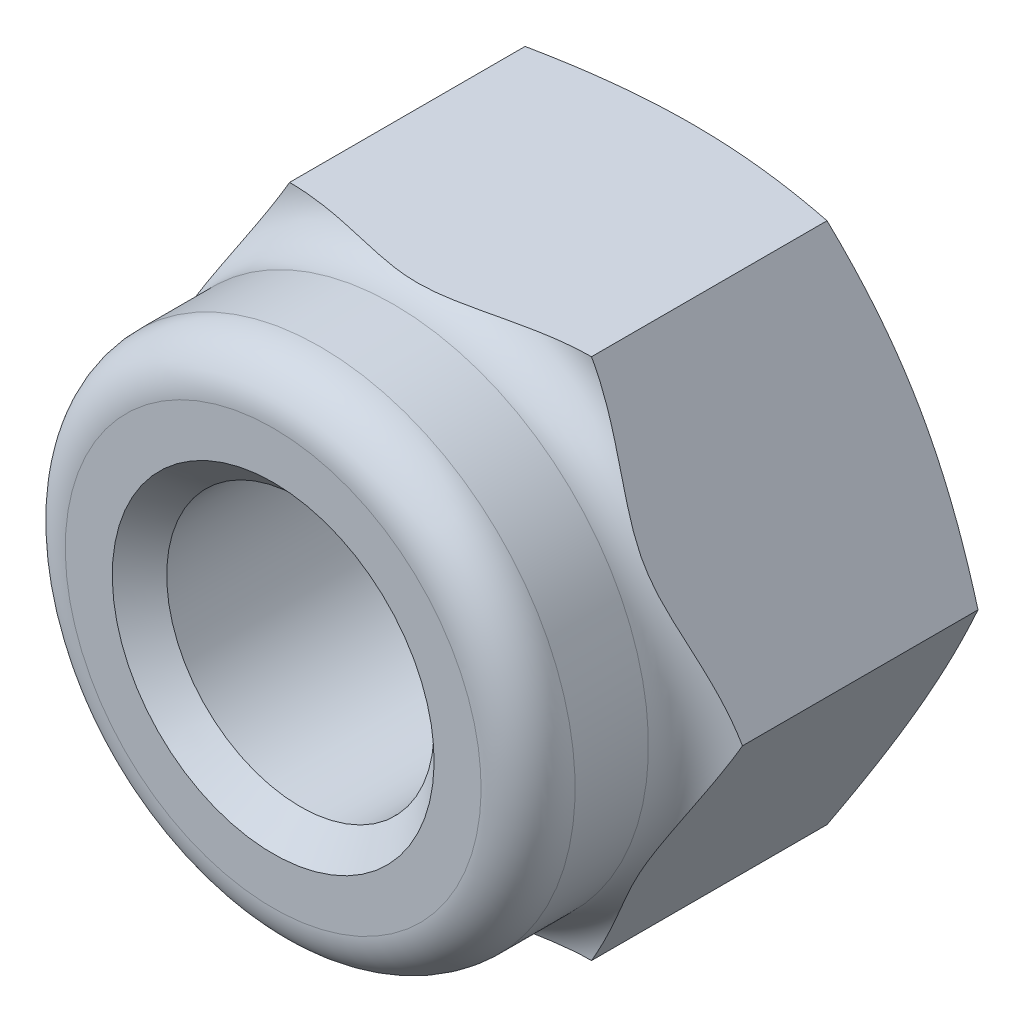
ISO-10303-21;
HEADER;
FILE_DESCRIPTION(('STEP AP214'),'2;1');
FILE_NAME('part.step','',(''),(''),'','','');
FILE_SCHEMA(('AUTOMOTIVE_DESIGN { 1 0 10303 214 1 1 1 1 }'));
ENDSEC;
DATA;
#1=APPLICATION_CONTEXT('core data for automotive mechanical design processes');
#2=APPLICATION_PROTOCOL_DEFINITION('international standard','automotive_design',2000,#1);
#3=PRODUCT_CONTEXT('',#1,'mechanical');
#4=PRODUCT('Part','Part','',(#3));
#5=PRODUCT_RELATED_PRODUCT_CATEGORY('part','',(#4));
#6=PRODUCT_DEFINITION_FORMATION('','',#4);
#7=PRODUCT_DEFINITION_CONTEXT('part definition',#1,'design');
#8=PRODUCT_DEFINITION('design','',#6,#7);
#9=PRODUCT_DEFINITION_SHAPE('','',#8);
#10=(LENGTH_UNIT() NAMED_UNIT(*) SI_UNIT(.MILLI.,.METRE.));
#11=(NAMED_UNIT(*) PLANE_ANGLE_UNIT() SI_UNIT($,.RADIAN.));
#12=(NAMED_UNIT(*) SI_UNIT($,.STERADIAN.) SOLID_ANGLE_UNIT());
#13=UNCERTAINTY_MEASURE_WITH_UNIT(LENGTH_MEASURE(1.E-05),#10,'distance_accuracy_value','');
#14=(GEOMETRIC_REPRESENTATION_CONTEXT(3) GLOBAL_UNCERTAINTY_ASSIGNED_CONTEXT((#13)) GLOBAL_UNIT_ASSIGNED_CONTEXT((#10,
#11,#12)) REPRESENTATION_CONTEXT('',''));
#15=CARTESIAN_POINT('',(0.,0.,0.));
#16=DIRECTION('',(0.,0.,1.));
#17=DIRECTION('',(1.,0.,0.));
#18=AXIS2_PLACEMENT_3D('',#15,#16,#17);
#19=CARTESIAN_POINT('',(0.,0.,0.));
#20=DIRECTION('',(0.,0.,1.));
#21=DIRECTION('',(0.,-1.,0.));
#22=AXIS2_PLACEMENT_3D('',#19,#20,#21);
#23=CONICAL_SURFACE('',#22,6.05649915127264,1.18682389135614);
#24=CARTESIAN_POINT('',(0.,0.,0.));
#25=DIRECTION('',(0.,0.,1.));
#26=DIRECTION('',(1.,0.,0.));
#27=AXIS2_PLACEMENT_3D('',#24,#25,#26);
#28=CIRCLE('',#27,6.05649915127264);
#29=CARTESIAN_POINT('',(6.05649915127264,0.,0.));
#30=VERTEX_POINT('',#29);
#31=EDGE_CURVE('E202',#30,#30,#28,.T.);
#32=ORIENTED_EDGE('',*,*,#31,.T.);
#33=EDGE_LOOP('',(#32));
#34=FACE_BOUND('',#33,.T.);
#35=CARTESIAN_POINT('',(3.75277488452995,6.49999716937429,0.585454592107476));
#36=CARTESIAN_POINT('',(3.88388671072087,6.27290482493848,0.532478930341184));
#37=CARTESIAN_POINT('',(4.0154312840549,6.04506294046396,0.483494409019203));
#38=CARTESIAN_POINT('',(4.27939025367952,5.58787259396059,0.395013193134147));
#39=CARTESIAN_POINT('',(4.41180511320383,5.35852332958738,0.35552205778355));
#40=CARTESIAN_POINT('',(4.67731617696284,4.89864467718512,0.28760872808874));
#41=CARTESIAN_POINT('',(4.81041216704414,4.66811566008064,0.259183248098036));
#42=CARTESIAN_POINT('',(5.07709854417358,4.20620130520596,0.214718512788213));
#43=CARTESIAN_POINT('',(5.21068881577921,3.97481616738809,0.198676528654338));
#44=CARTESIAN_POINT('',(5.47583563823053,3.51556839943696,0.179976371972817));
#45=CARTESIAN_POINT('',(5.60738820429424,3.28771267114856,0.177095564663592));
#46=CARTESIAN_POINT('',(5.87041559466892,2.83213586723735,0.184267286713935));
#47=CARTESIAN_POINT('',(6.00189041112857,2.60441480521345,0.194320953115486));
#48=CARTESIAN_POINT('',(6.26436520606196,2.1497951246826,0.226821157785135));
#49=CARTESIAN_POINT('',(6.39536543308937,1.92289607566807,0.249259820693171));
#50=CARTESIAN_POINT('',(6.65674042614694,1.47018130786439,0.305442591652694));
#51=CARTESIAN_POINT('',(6.78711525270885,1.24436548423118,0.339185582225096));
#52=CARTESIAN_POINT('',(6.96628658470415,0.934031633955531,0.392523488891));
#53=CARTESIAN_POINT('',(7.01540954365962,0.848948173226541,0.407872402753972));
#54=CARTESIAN_POINT('',(7.11353952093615,0.678982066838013,0.439906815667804));
#55=CARTESIAN_POINT('',(7.16254655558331,0.594099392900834,0.456592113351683));
#56=CARTESIAN_POINT('',(7.26061650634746,0.424237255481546,0.491281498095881));
#57=CARTESIAN_POINT('',(7.30967903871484,0.339258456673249,0.50928990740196));
#58=CARTESIAN_POINT('',(7.40769660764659,0.169487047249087,0.546498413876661));
#59=CARTESIAN_POINT('',(7.45665163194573,0.0846944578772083,0.565698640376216));
#60=CARTESIAN_POINT('',(7.50555011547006,-2.00000000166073E-07,0.585454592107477));
#61=B_SPLINE_CURVE_WITH_KNOTS('',3,(#35,#36,#37,#38,#39,#40,#41,#42,#43,#44,#45,#46,#47,#48,#49,
#50,#51,#52,#53,#54,#55,#56,#57,#58,#59,#60),.UNSPECIFIED.,.F.,.F.,(4,2,2,2,2,2,2,2,2,2,2,2,4),
(0.,0.802620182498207,1.60570923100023,2.40855964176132,3.21123308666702,4.00027695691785,
4.78939019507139,5.57800222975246,6.36653632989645,6.66484369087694,6.96310618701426,
7.26239050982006,7.56170736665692),.UNSPECIFIED.);
#62=CARTESIAN_POINT('',(3.752775,6.49999696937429,0.585454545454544));
#63=VERTEX_POINT('',#62);
#64=CARTESIAN_POINT('',(7.50555,0.,0.585454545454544));
#65=VERTEX_POINT('',#64);
#66=EDGE_CURVE('E44',#63,#65,#61,.T.);
#67=ORIENTED_EDGE('',*,*,#66,.T.);
#68=CARTESIAN_POINT('',(7.50555011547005,1.99999999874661E-07,0.585454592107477));
#69=CARTESIAN_POINT('',(7.37443828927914,-0.22709214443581,0.532478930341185));
#70=CARTESIAN_POINT('',(7.2428937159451,-0.454934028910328,0.483494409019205));
#71=CARTESIAN_POINT('',(6.97893474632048,-0.912124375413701,0.395013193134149));
#72=CARTESIAN_POINT('',(6.84651988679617,-1.14147363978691,0.355522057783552));
#73=CARTESIAN_POINT('',(6.58100882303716,-1.60135229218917,0.287608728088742));
#74=CARTESIAN_POINT('',(6.44791283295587,-1.83188130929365,0.259183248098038));
#75=CARTESIAN_POINT('',(6.18122645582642,-2.29379566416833,0.214718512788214));
#76=CARTESIAN_POINT('',(6.04763618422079,-2.5251808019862,0.19867652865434));
#77=CARTESIAN_POINT('',(5.78248936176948,-2.98442856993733,0.179976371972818));
#78=CARTESIAN_POINT('',(5.65093679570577,-3.21228429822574,0.177095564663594));
#79=CARTESIAN_POINT('',(5.38790940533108,-3.66786110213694,0.184267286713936));
#80=CARTESIAN_POINT('',(5.25643458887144,-3.89558216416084,0.194320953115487));
#81=CARTESIAN_POINT('',(4.99395979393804,-4.3502018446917,0.226821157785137));
#82=CARTESIAN_POINT('',(4.86295956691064,-4.57710089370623,0.249259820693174));
#83=CARTESIAN_POINT('',(4.60158457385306,-5.0298156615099,0.305442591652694));
#84=CARTESIAN_POINT('',(4.47120974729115,-5.25563148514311,0.339185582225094));
#85=CARTESIAN_POINT('',(4.29203841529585,-5.56596533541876,0.392523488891));
#86=CARTESIAN_POINT('',(4.24291545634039,-5.65104879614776,0.407872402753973));
#87=CARTESIAN_POINT('',(4.14478547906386,-5.82101490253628,0.439906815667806));
#88=CARTESIAN_POINT('',(4.09577844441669,-5.90589757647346,0.456592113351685));
#89=CARTESIAN_POINT('',(3.99770849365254,-6.07575971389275,0.491281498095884));
#90=CARTESIAN_POINT('',(3.94864596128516,-6.16073851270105,0.509289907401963));
#91=CARTESIAN_POINT('',(3.85062839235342,-6.33050992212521,0.546498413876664));
#92=CARTESIAN_POINT('',(3.80167336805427,-6.41530251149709,0.565698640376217));
#93=CARTESIAN_POINT('',(3.75277488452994,-6.4999971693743,0.585454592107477));
#94=B_SPLINE_CURVE_WITH_KNOTS('',3,(#68,#69,#70,#71,#72,#73,#74,#75,#76,#77,#78,#79,#80,#81,#82,
#83,#84,#85,#86,#87,#88,#89,#90,#91,#92,#93),.UNSPECIFIED.,.F.,.F.,(4,2,2,2,2,2,2,2,2,2,2,2,4),
(0.,0.802620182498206,1.60570923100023,2.40855964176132,3.21123308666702,4.00027695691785,
4.78939019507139,5.57800222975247,6.36653632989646,6.66484369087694,6.96310618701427,
7.26239050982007,7.56170736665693),.UNSPECIFIED.);
#95=CARTESIAN_POINT('',(3.752775,-6.4999969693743,0.585454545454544));
#96=VERTEX_POINT('',#95);
#97=EDGE_CURVE('E37',#65,#96,#94,.T.);
#98=ORIENTED_EDGE('',*,*,#97,.T.);
#99=CARTESIAN_POINT('',(-9.9227189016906,-6.49999696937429,2.34563023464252));
#100=CARTESIAN_POINT('',(-9.62950531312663,-6.49999696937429,2.24656127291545));
#101=CARTESIAN_POINT('',(-9.33590180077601,-6.49999696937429,2.14862508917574));
#102=CARTESIAN_POINT('',(-8.74771317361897,-6.49999696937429,1.95565116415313));
#103=CARTESIAN_POINT('',(-8.45312796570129,-6.49999696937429,1.86061370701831));
#104=CARTESIAN_POINT('',(-7.86211918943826,-6.49999696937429,1.67386467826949));
#105=CARTESIAN_POINT('',(-7.56569290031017,-6.49999696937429,1.58216168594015));
#106=CARTESIAN_POINT('',(-6.97150203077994,-6.49999696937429,1.40320820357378));
#107=CARTESIAN_POINT('',(-6.67373748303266,-6.49999696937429,1.31595760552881));
#108=CARTESIAN_POINT('',(-6.08046439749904,-6.49999696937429,1.14811646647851));
#109=CARTESIAN_POINT('',(-5.78497611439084,-6.49999696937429,1.06745468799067));
#110=CARTESIAN_POINT('',(-5.19220251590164,-6.49999696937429,0.912940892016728));
#111=CARTESIAN_POINT('',(-4.89491714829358,-6.49999696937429,0.839089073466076));
#112=CARTESIAN_POINT('',(-4.29850609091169,-6.49999696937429,0.699959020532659));
#113=CARTESIAN_POINT('',(-3.99938152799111,-6.49999696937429,0.634675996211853));
#114=CARTESIAN_POINT('',(-3.39900623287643,-6.49999696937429,0.51470123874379));
#115=CARTESIAN_POINT('',(-3.09775565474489,-6.49999696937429,0.460008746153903));
#116=CARTESIAN_POINT('',(-2.55500324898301,-6.49999696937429,0.373374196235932));
#117=CARTESIAN_POINT('',(-2.3138808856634,-6.49999696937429,0.339066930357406));
#118=CARTESIAN_POINT('',(-1.83048662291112,-6.49999696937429,0.27974795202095));
#119=CARTESIAN_POINT('',(-1.58821475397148,-6.49999696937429,0.254735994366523));
#120=CARTESIAN_POINT('',(-1.10297622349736,-6.49999696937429,0.214997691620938));
#121=CARTESIAN_POINT('',(-0.860010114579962,-6.49999696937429,0.200264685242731));
#122=CARTESIAN_POINT('',(-0.373657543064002,-6.49999696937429,0.181701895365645));
#123=CARTESIAN_POINT('',(-0.130271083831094,-6.49999696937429,0.177872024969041));
#124=CARTESIAN_POINT('',(0.357598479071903,-6.49999696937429,0.181300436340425));
#125=CARTESIAN_POINT('',(0.602081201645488,-6.49999696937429,0.188612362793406));
#126=CARTESIAN_POINT('',(1.09047631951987,-6.49999696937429,0.214086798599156));
#127=CARTESIAN_POINT('',(1.33438870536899,-6.49999696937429,0.232249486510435));
#128=CARTESIAN_POINT('',(1.82139663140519,-6.49999696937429,0.278662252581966));
#129=CARTESIAN_POINT('',(2.06449155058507,-6.49999696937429,0.306918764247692));
#130=CARTESIAN_POINT('',(2.54944669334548,-6.49999696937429,0.372452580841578));
#131=CARTESIAN_POINT('',(2.79130692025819,-6.4999969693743,0.409729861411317));
#132=CARTESIAN_POINT('',(3.31388842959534,-6.4999969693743,0.498994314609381));
#133=CARTESIAN_POINT('',(3.59436620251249,-6.4999969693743,0.552397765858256));
#134=CARTESIAN_POINT('',(4.15350616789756,-6.49999696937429,0.668051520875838));
#135=CARTESIAN_POINT('',(4.43216813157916,-6.49999696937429,0.730302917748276));
#136=CARTESIAN_POINT('',(4.98790749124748,-6.4999969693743,0.862050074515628));
#137=CARTESIAN_POINT('',(5.26498403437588,-6.49999696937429,0.931549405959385));
#138=CARTESIAN_POINT('',(5.81758450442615,-6.49999696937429,1.07639396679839));
#139=CARTESIAN_POINT('',(6.09310848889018,-6.4999969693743,1.15173897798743));
#140=CARTESIAN_POINT('',(6.64353453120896,-6.4999969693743,1.30736863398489));
#141=CARTESIAN_POINT('',(6.91843304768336,-6.4999969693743,1.38766574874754));
#142=CARTESIAN_POINT('',(7.46706924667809,-6.4999969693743,1.55212558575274));
#143=CARTESIAN_POINT('',(7.74080692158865,-6.4999969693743,1.63628833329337));
#144=CARTESIAN_POINT('',(8.28721389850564,-6.4999969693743,1.80774471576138));
#145=CARTESIAN_POINT('',(8.55988347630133,-6.4999969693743,1.89503747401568));
#146=CARTESIAN_POINT('',(9.10437871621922,-6.4999969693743,2.07221993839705));
#147=CARTESIAN_POINT('',(9.37620436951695,-6.4999969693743,2.16210967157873));
#148=CARTESIAN_POINT('',(10.1869857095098,-6.4999969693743,2.43376910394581));
#149=CARTESIAN_POINT('',(10.7248866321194,-6.4999969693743,2.6186857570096));
#150=CARTESIAN_POINT('',(11.7986523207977,-6.4999969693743,2.99443274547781));
#151=CARTESIAN_POINT('',(12.334516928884,-6.4999969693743,3.18526352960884));
#152=CARTESIAN_POINT('',(13.4011523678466,-6.4999969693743,3.56993391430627));
#153=CARTESIAN_POINT('',(13.9319334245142,-6.4999969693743,3.7637452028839));
#154=CARTESIAN_POINT('',(14.7271969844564,-6.4999969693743,4.05681596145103));
#155=CARTESIAN_POINT('',(14.992116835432,-6.4999969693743,4.15489226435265));
#156=CARTESIAN_POINT('',(15.5216980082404,-6.4999969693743,4.35173756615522));
#157=CARTESIAN_POINT('',(15.7863593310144,-6.4999969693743,4.4505065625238));
#158=CARTESIAN_POINT('',(16.0509088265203,-6.4999969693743,4.54957435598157));
#159=B_SPLINE_CURVE_WITH_KNOTS('',3,(#99,#100,#101,#102,#103,#104,#105,#106,#107,#108,#109,#110,
#111,#112,#113,#114,#115,#116,#117,#118,#119,#120,#121,#122,#123,#124,#125,#126,#127,#128,#129,
#130,#131,#132,#133,#134,#135,#136,#137,#138,#139,#140,#141,#142,#143,#144,#145,#146,#147,#148,
#149,#150,#151,#152,#153,#154,#155,#156,#157,#158),.UNSPECIFIED.,.F.,.F.,(4,2,2,2,2,2,2,2,2,2,2,
2,2,2,2,2,2,2,2,2,2,2,2,2,2,2,2,2,2,4),(0.,0.928501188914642,1.8570931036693,2.78792584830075,
3.71873600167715,4.6375720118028,5.5564348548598,6.47478184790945,7.39306296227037,
8.12355979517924,8.85403735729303,9.58404109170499,10.3140390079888,11.0475627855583,
11.781098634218,12.5151028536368,13.2491050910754,14.1054763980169,14.9619535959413,
15.8188548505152,16.6757241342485,17.5348469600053,18.3939754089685,19.2528650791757,
20.1117637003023,21.8181018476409,23.5245697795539,25.2197314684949,26.0672055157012,
26.9146764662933),.UNSPECIFIED.);
#160=CARTESIAN_POINT('',(-3.752775,-6.49999696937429,0.585454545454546));
#161=VERTEX_POINT('',#160);
#162=EDGE_CURVE('E82',#96,#161,#159,.F.);
#163=ORIENTED_EDGE('',*,*,#162,.T.);
#164=CARTESIAN_POINT('',(-3.75277488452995,-6.49999716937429,0.585454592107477));
#165=CARTESIAN_POINT('',(-3.88388671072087,-6.27290482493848,0.532478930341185));
#166=CARTESIAN_POINT('',(-4.0154312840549,-6.04506294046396,0.483494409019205));
#167=CARTESIAN_POINT('',(-4.27939025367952,-5.58787259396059,0.395013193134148));
#168=CARTESIAN_POINT('',(-4.41180511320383,-5.35852332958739,0.35552205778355));
#169=CARTESIAN_POINT('',(-4.67731617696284,-4.89864467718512,0.287608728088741));
#170=CARTESIAN_POINT('',(-4.81041216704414,-4.66811566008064,0.259183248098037));
#171=CARTESIAN_POINT('',(-5.07709854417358,-4.20620130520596,0.214718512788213));
#172=CARTESIAN_POINT('',(-5.21068881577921,-3.97481616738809,0.198676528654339));
#173=CARTESIAN_POINT('',(-5.47583563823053,-3.51556839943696,0.179976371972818));
#174=CARTESIAN_POINT('',(-5.60738820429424,-3.28771267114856,0.177095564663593));
#175=CARTESIAN_POINT('',(-5.87041559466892,-2.83213586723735,0.184267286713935));
#176=CARTESIAN_POINT('',(-6.00189041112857,-2.60441480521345,0.194320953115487));
#177=CARTESIAN_POINT('',(-6.26436520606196,-2.14979512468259,0.226821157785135));
#178=CARTESIAN_POINT('',(-6.39536543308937,-1.92289607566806,0.249259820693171));
#179=CARTESIAN_POINT('',(-6.65674042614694,-1.47018130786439,0.305442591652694));
#180=CARTESIAN_POINT('',(-6.78711525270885,-1.24436548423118,0.339185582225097));
#181=CARTESIAN_POINT('',(-6.96628658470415,-0.934031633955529,0.392523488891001));
#182=CARTESIAN_POINT('',(-7.01540954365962,-0.848948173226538,0.407872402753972));
#183=CARTESIAN_POINT('',(-7.11353952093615,-0.678982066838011,0.439906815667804));
#184=CARTESIAN_POINT('',(-7.16254655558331,-0.594099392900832,0.456592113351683));
#185=CARTESIAN_POINT('',(-7.26061650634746,-0.424237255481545,0.491281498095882));
#186=CARTESIAN_POINT('',(-7.30967903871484,-0.339258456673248,0.509289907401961));
#187=CARTESIAN_POINT('',(-7.40769660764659,-0.169487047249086,0.546498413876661));
#188=CARTESIAN_POINT('',(-7.45665163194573,-0.0846944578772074,0.565698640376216));
#189=CARTESIAN_POINT('',(-7.50555011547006,2.00000001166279E-07,0.585454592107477));
#190=B_SPLINE_CURVE_WITH_KNOTS('',3,(#164,#165,#166,#167,#168,#169,#170,#171,#172,#173,#174,
#175,#176,#177,#178,#179,#180,#181,#182,#183,#184,#185,#186,#187,#188,#189),.UNSPECIFIED.,.F.,
.F.,(4,2,2,2,2,2,2,2,2,2,2,2,4),(0.,0.802620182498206,1.60570923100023,2.40855964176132,
3.21123308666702,4.00027695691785,4.78939019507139,5.57800222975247,6.36653632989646,
6.66484369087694,6.96310618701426,7.26239050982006,7.56170736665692),.UNSPECIFIED.);
#191=CARTESIAN_POINT('',(-7.50555,0.,0.585454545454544));
#192=VERTEX_POINT('',#191);
#193=EDGE_CURVE('E90',#161,#192,#190,.T.);
#194=ORIENTED_EDGE('',*,*,#193,.T.);
#195=CARTESIAN_POINT('',(-7.50555011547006,-1.99999999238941E-07,0.585454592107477));
#196=CARTESIAN_POINT('',(-7.37443828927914,0.227092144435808,0.532478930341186));
#197=CARTESIAN_POINT('',(-7.24289371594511,0.454934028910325,0.483494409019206));
#198=CARTESIAN_POINT('',(-6.97893474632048,0.912124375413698,0.395013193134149));
#199=CARTESIAN_POINT('',(-6.84651988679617,1.1414736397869,0.355522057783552));
#200=CARTESIAN_POINT('',(-6.58100882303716,1.60135229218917,0.287608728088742));
#201=CARTESIAN_POINT('',(-6.44791283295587,1.83188130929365,0.259183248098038));
#202=CARTESIAN_POINT('',(-6.18122645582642,2.29379566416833,0.214718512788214));
#203=CARTESIAN_POINT('',(-6.04763618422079,2.5251808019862,0.198676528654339));
#204=CARTESIAN_POINT('',(-5.78248936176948,2.98442856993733,0.179976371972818));
#205=CARTESIAN_POINT('',(-5.65093679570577,3.21228429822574,0.177095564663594));
#206=CARTESIAN_POINT('',(-5.38790940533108,3.66786110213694,0.184267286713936));
#207=CARTESIAN_POINT('',(-5.25643458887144,3.89558216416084,0.194320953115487));
#208=CARTESIAN_POINT('',(-4.99395979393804,4.3502018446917,0.226821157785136));
#209=CARTESIAN_POINT('',(-4.86295956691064,4.57710089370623,0.249259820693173));
#210=CARTESIAN_POINT('',(-4.60158457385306,5.0298156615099,0.305442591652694));
#211=CARTESIAN_POINT('',(-4.47120974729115,5.25563148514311,0.339185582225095));
#212=CARTESIAN_POINT('',(-4.29203841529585,5.56596533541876,0.392523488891));
#213=CARTESIAN_POINT('',(-4.24291545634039,5.65104879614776,0.407872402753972));
#214=CARTESIAN_POINT('',(-4.14478547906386,5.82101490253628,0.439906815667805));
#215=CARTESIAN_POINT('',(-4.09577844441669,5.90589757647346,0.456592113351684));
#216=CARTESIAN_POINT('',(-3.99770849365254,6.07575971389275,0.491281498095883));
#217=CARTESIAN_POINT('',(-3.94864596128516,6.16073851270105,0.509289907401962));
#218=CARTESIAN_POINT('',(-3.85062839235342,6.33050992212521,0.546498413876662));
#219=CARTESIAN_POINT('',(-3.80167336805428,6.41530251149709,0.565698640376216));
#220=CARTESIAN_POINT('',(-3.75277488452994,6.4999971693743,0.585454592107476));
#221=B_SPLINE_CURVE_WITH_KNOTS('',3,(#195,#196,#197,#198,#199,#200,#201,#202,#203,#204,#205,
#206,#207,#208,#209,#210,#211,#212,#213,#214,#215,#216,#217,#218,#219,#220),.UNSPECIFIED.,.F.,
.F.,(4,2,2,2,2,2,2,2,2,2,2,2,4),(0.,0.802620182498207,1.60570923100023,2.40855964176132,
3.21123308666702,4.00027695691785,4.78939019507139,5.57800222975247,6.36653632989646,
6.66484369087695,6.96310618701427,7.26239050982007,7.56170736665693),.UNSPECIFIED.);
#222=CARTESIAN_POINT('',(-3.752775,6.4999969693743,0.585454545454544));
#223=VERTEX_POINT('',#222);
#224=EDGE_CURVE('E95',#192,#223,#221,.T.);
#225=ORIENTED_EDGE('',*,*,#224,.T.);
#226=CARTESIAN_POINT('',(-9.92271890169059,6.4999969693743,2.34563023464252));
#227=CARTESIAN_POINT('',(-9.62950531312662,6.49999696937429,2.24656127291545));
#228=CARTESIAN_POINT('',(-9.335901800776,6.49999696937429,2.14862508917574));
#229=CARTESIAN_POINT('',(-8.74771317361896,6.49999696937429,1.95565116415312));
#230=CARTESIAN_POINT('',(-8.45312796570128,6.49999696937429,1.8606137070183));
#231=CARTESIAN_POINT('',(-7.86211918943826,6.49999696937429,1.67386467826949));
#232=CARTESIAN_POINT('',(-7.56569290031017,6.49999696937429,1.58216168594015));
#233=CARTESIAN_POINT('',(-6.97150203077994,6.49999696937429,1.40320820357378));
#234=CARTESIAN_POINT('',(-6.67373748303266,6.49999696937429,1.3159576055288));
#235=CARTESIAN_POINT('',(-6.08046439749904,6.49999696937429,1.14811646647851));
#236=CARTESIAN_POINT('',(-5.78497611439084,6.49999696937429,1.06745468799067));
#237=CARTESIAN_POINT('',(-5.19220251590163,6.49999696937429,0.912940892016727));
#238=CARTESIAN_POINT('',(-4.89491714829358,6.49999696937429,0.839089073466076));
#239=CARTESIAN_POINT('',(-4.29850609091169,6.49999696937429,0.699959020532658));
#240=CARTESIAN_POINT('',(-3.9993815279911,6.49999696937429,0.634675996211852));
#241=CARTESIAN_POINT('',(-3.39900623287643,6.49999696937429,0.514701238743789));
#242=CARTESIAN_POINT('',(-3.09775565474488,6.4999969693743,0.460008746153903));
#243=CARTESIAN_POINT('',(-2.555003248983,6.4999969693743,0.373374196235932));
#244=CARTESIAN_POINT('',(-2.31388088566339,6.49999696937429,0.339066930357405));
#245=CARTESIAN_POINT('',(-1.83048662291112,6.49999696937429,0.279747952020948));
#246=CARTESIAN_POINT('',(-1.58821475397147,6.49999696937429,0.254735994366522));
#247=CARTESIAN_POINT('',(-1.10297622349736,6.49999696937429,0.214997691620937));
#248=CARTESIAN_POINT('',(-0.860010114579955,6.49999696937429,0.200264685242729));
#249=CARTESIAN_POINT('',(-0.373657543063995,6.49999696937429,0.181701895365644));
#250=CARTESIAN_POINT('',(-0.130271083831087,6.49999696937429,0.17787202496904));
#251=CARTESIAN_POINT('',(0.35759847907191,6.49999696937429,0.181300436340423));
#252=CARTESIAN_POINT('',(0.602081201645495,6.49999696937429,0.188612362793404));
#253=CARTESIAN_POINT('',(1.09047631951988,6.49999696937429,0.214086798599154));
#254=CARTESIAN_POINT('',(1.33438870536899,6.49999696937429,0.232249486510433));
#255=CARTESIAN_POINT('',(1.82139663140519,6.49999696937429,0.278662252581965));
#256=CARTESIAN_POINT('',(2.06449155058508,6.49999696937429,0.30691876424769));
#257=CARTESIAN_POINT('',(2.54944669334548,6.49999696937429,0.372452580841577));
#258=CARTESIAN_POINT('',(2.79130692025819,6.49999696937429,0.409729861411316));
#259=CARTESIAN_POINT('',(3.31388842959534,6.49999696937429,0.49899431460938));
#260=CARTESIAN_POINT('',(3.5943662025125,6.49999696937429,0.552397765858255));
#261=CARTESIAN_POINT('',(4.15350616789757,6.49999696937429,0.668051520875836));
#262=CARTESIAN_POINT('',(4.43216813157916,6.49999696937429,0.730302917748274));
#263=CARTESIAN_POINT('',(4.98790749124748,6.49999696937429,0.862050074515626));
#264=CARTESIAN_POINT('',(5.26498403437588,6.49999696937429,0.931549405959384));
#265=CARTESIAN_POINT('',(5.81758450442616,6.49999696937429,1.07639396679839));
#266=CARTESIAN_POINT('',(6.09310848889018,6.49999696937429,1.15173897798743));
#267=CARTESIAN_POINT('',(6.64353453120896,6.49999696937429,1.30736863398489));
#268=CARTESIAN_POINT('',(6.91843304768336,6.49999696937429,1.38766574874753));
#269=CARTESIAN_POINT('',(7.46706924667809,6.49999696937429,1.55212558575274));
#270=CARTESIAN_POINT('',(7.74080692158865,6.49999696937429,1.63628833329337));
#271=CARTESIAN_POINT('',(8.28721389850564,6.49999696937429,1.80774471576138));
#272=CARTESIAN_POINT('',(8.55988347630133,6.49999696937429,1.89503747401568));
#273=CARTESIAN_POINT('',(9.10437871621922,6.49999696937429,2.07221993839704));
#274=CARTESIAN_POINT('',(9.37620436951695,6.49999696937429,2.16210967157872));
#275=CARTESIAN_POINT('',(10.1869857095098,6.49999696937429,2.43376910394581));
#276=CARTESIAN_POINT('',(10.7248866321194,6.49999696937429,2.6186857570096));
#277=CARTESIAN_POINT('',(11.7986523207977,6.49999696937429,2.99443274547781));
#278=CARTESIAN_POINT('',(12.334516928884,6.49999696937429,3.18526352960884));
#279=CARTESIAN_POINT('',(13.4011523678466,6.49999696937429,3.56993391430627));
#280=CARTESIAN_POINT('',(13.9319334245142,6.49999696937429,3.7637452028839));
#281=CARTESIAN_POINT('',(14.7271969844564,6.49999696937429,4.05681596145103));
#282=CARTESIAN_POINT('',(14.992116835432,6.49999696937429,4.15489226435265));
#283=CARTESIAN_POINT('',(15.5216980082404,6.49999696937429,4.35173756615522));
#284=CARTESIAN_POINT('',(15.7863593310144,6.49999696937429,4.4505065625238));
#285=CARTESIAN_POINT('',(16.0509088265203,6.49999696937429,4.54957435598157));
#286=B_SPLINE_CURVE_WITH_KNOTS('',3,(#226,#227,#228,#229,#230,#231,#232,#233,#234,#235,#236,
#237,#238,#239,#240,#241,#242,#243,#244,#245,#246,#247,#248,#249,#250,#251,#252,#253,#254,#255,
#256,#257,#258,#259,#260,#261,#262,#263,#264,#265,#266,#267,#268,#269,#270,#271,#272,#273,#274,
#275,#276,#277,#278,#279,#280,#281,#282,#283,#284,#285),.UNSPECIFIED.,.F.,.F.,(4,2,2,2,2,2,2,2,
2,2,2,2,2,2,2,2,2,2,2,2,2,2,2,2,2,2,2,2,2,4),(0.,0.928501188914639,1.8570931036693,
2.78792584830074,3.71873600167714,4.6375720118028,5.55643485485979,6.47478184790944,
7.39306296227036,8.12355979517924,8.85403735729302,9.58404109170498,10.3140390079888,
11.0475627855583,11.781098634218,12.5151028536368,13.2491050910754,14.1054763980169,
14.9619535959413,15.8188548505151,16.6757241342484,17.5348469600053,18.3939754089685,
19.2528650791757,20.1117637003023,21.8181018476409,23.5245697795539,25.2197314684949,
26.0672055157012,26.9146764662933),.UNSPECIFIED.);
#287=EDGE_CURVE('E180',#223,#63,#286,.T.);
#288=ORIENTED_EDGE('',*,*,#287,.T.);
#289=EDGE_LOOP('',(#67,#98,#163,#194,#225,#288));
#290=FACE_BOUND('',#289,.T.);
#291=ADVANCED_FACE('F17',(#34,#290),#23,.T.);
#292=CARTESIAN_POINT('',(7.50555,0.,0.));
#293=DIRECTION('',(0.,0.,1.));
#294=DIRECTION('',(1.,0.,0.));
#295=AXIS2_PLACEMENT_3D('',#292,#293,#294);
#296=PLANE('',#295);
#297=CARTESIAN_POINT('',(0.,0.,0.));
#298=DIRECTION('',(0.,0.,1.));
#299=DIRECTION('',(1.,0.,0.));
#300=AXIS2_PLACEMENT_3D('',#297,#298,#299);
#301=CIRCLE('',#300,4.);
#302=CARTESIAN_POINT('',(4.,0.,0.));
#303=VERTEX_POINT('',#302);
#304=EDGE_CURVE('E205',#303,#303,#301,.F.);
#305=ORIENTED_EDGE('',*,*,#304,.F.);
#306=EDGE_LOOP('',(#305));
#307=FACE_BOUND('',#306,.T.);
#308=ORIENTED_EDGE('',*,*,#31,.F.);
#309=EDGE_LOOP('',(#308));
#310=FACE_BOUND('',#309,.T.);
#311=ADVANCED_FACE('F224',(#307,#310),#296,.F.);
#312=CARTESIAN_POINT('',(0.,0.,10.6));
#313=DIRECTION('',(0.,0.,1.));
#314=DIRECTION('',(0.,-1.,0.));
#315=AXIS2_PLACEMENT_3D('',#312,#313,#314);
#316=CONICAL_SURFACE('',#315,4.,0.785398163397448);
#317=CARTESIAN_POINT('',(0.,0.,9.9234375));
#318=DIRECTION('',(0.,0.,-1.));
#319=DIRECTION('',(0.,1.,0.));
#320=AXIS2_PLACEMENT_3D('',#317,#318,#319);
#321=CIRCLE('',#320,3.3234375);
#322=CARTESIAN_POINT('',(0.,3.3234375,9.9234375));
#323=VERTEX_POINT('',#322);
#324=EDGE_CURVE('E244',#323,#323,#321,.T.);
#325=ORIENTED_EDGE('',*,*,#324,.T.);
#326=EDGE_LOOP('',(#325));
#327=FACE_BOUND('',#326,.T.);
#328=CARTESIAN_POINT('',(0.,0.,10.6));
#329=DIRECTION('',(0.,0.,-1.));
#330=DIRECTION('',(0.,1.,0.));
#331=AXIS2_PLACEMENT_3D('',#328,#329,#330);
#332=CIRCLE('',#331,4.);
#333=CARTESIAN_POINT('',(0.,4.,10.6));
#334=VERTEX_POINT('',#333);
#335=EDGE_CURVE('E247',#334,#334,#332,.T.);
#336=ORIENTED_EDGE('',*,*,#335,.F.);
#337=EDGE_LOOP('',(#336));
#338=FACE_BOUND('',#337,.T.);
#339=ADVANCED_FACE('F229',(#327,#338),#316,.F.);
#340=CARTESIAN_POINT('',(0.,0.,0.));
#341=DIRECTION('',(0.,0.,-1.));
#342=DIRECTION('',(0.,1.,0.));
#343=AXIS2_PLACEMENT_3D('',#340,#341,#342);
#344=CYLINDRICAL_SURFACE('',#343,3.3234375);
#345=CARTESIAN_POINT('',(0.,0.,0.6765625));
#346=DIRECTION('',(0.,0.,-1.));
#347=DIRECTION('',(0.,1.,0.));
#348=AXIS2_PLACEMENT_3D('',#345,#346,#347);
#349=CIRCLE('',#348,3.3234375);
#350=CARTESIAN_POINT('',(0.,3.3234375,0.6765625));
#351=VERTEX_POINT('',#350);
#352=EDGE_CURVE('E242',#351,#351,#349,.T.);
#353=ORIENTED_EDGE('',*,*,#352,.T.);
#354=EDGE_LOOP('',(#353));
#355=FACE_BOUND('',#354,.T.);
#356=ORIENTED_EDGE('',*,*,#324,.F.);
#357=EDGE_LOOP('',(#356));
#358=FACE_BOUND('',#357,.T.);
#359=ADVANCED_FACE('F220',(#355,#358),#344,.F.);
#360=CARTESIAN_POINT('',(0.,0.,0.6765625));
#361=DIRECTION('',(0.,0.,-1.));
#362=DIRECTION('',(0.,1.,0.));
#363=AXIS2_PLACEMENT_3D('',#360,#361,#362);
#364=CONICAL_SURFACE('',#363,3.3234375,0.785398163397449);
#365=ORIENTED_EDGE('',*,*,#304,.T.);
#366=EDGE_LOOP('',(#365));
#367=FACE_BOUND('',#366,.T.);
#368=ORIENTED_EDGE('',*,*,#352,.F.);
#369=EDGE_LOOP('',(#368));
#370=FACE_BOUND('',#369,.T.);
#371=ADVANCED_FACE('F214',(#367,#370),#364,.F.);
#372=CARTESIAN_POINT('',(7.50555,0.,10.6));
#373=DIRECTION('',(0.,0.,1.));
#374=DIRECTION('',(1.,0.,0.));
#375=AXIS2_PLACEMENT_3D('',#372,#373,#374);
#376=PLANE('',#375);
#377=ORIENTED_EDGE('',*,*,#335,.T.);
#378=EDGE_LOOP('',(#377));
#379=FACE_BOUND('',#378,.T.);
#380=CARTESIAN_POINT('',(0.,0.,10.6));
#381=DIRECTION('',(0.,0.,-1.));
#382=DIRECTION('',(0.,1.,0.));
#383=AXIS2_PLACEMENT_3D('',#380,#381,#382);
#384=CIRCLE('',#383,5.16851666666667);
#385=CARTESIAN_POINT('',(0.,5.16851666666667,10.6));
#386=VERTEX_POINT('',#385);
#387=EDGE_CURVE('E30',#386,#386,#384,.T.);
#388=ORIENTED_EDGE('',*,*,#387,.F.);
#389=EDGE_LOOP('',(#388));
#390=FACE_BOUND('',#389,.T.);
#391=ADVANCED_FACE('F117',(#379,#390),#376,.T.);
#392=CARTESIAN_POINT('',(0.,0.,7.60851666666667));
#393=DIRECTION('',(0.,0.,-1.));
#394=DIRECTION('',(0.,1.,0.));
#395=AXIS2_PLACEMENT_3D('',#392,#393,#394);
#396=TOROIDAL_SURFACE('',#395,7.50555,1.16851666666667);
#397=CARTESIAN_POINT('',(0.,0.,7.60851666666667));
#398=DIRECTION('',(0.,0.,-1.));
#399=DIRECTION('',(0.,1.,0.));
#400=AXIS2_PLACEMENT_3D('',#397,#398,#399);
#401=CIRCLE('',#400,6.33703333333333);
#402=CARTESIAN_POINT('',(0.,6.33703333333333,7.60851666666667));
#403=VERTEX_POINT('',#402);
#404=EDGE_CURVE('E97',#403,#403,#401,.T.);
#405=ORIENTED_EDGE('',*,*,#404,.T.);
#406=EDGE_LOOP('',(#405));
#407=FACE_BOUND('',#406,.T.);
#408=CARTESIAN_POINT('',(7.50555011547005,1.99999999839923E-07,6.44));
#409=CARTESIAN_POINT('',(7.45920361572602,-0.0802742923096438,6.44001852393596));
#410=CARTESIAN_POINT('',(7.41287919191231,-0.160510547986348,6.44275565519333));
#411=CARTESIAN_POINT('',(7.32039414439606,-0.320699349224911,6.45288997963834));
#412=CARTESIAN_POINT('',(7.27423341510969,-0.400652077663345,6.46028321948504));
#413=CARTESIAN_POINT('',(7.18235501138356,-0.559790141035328,6.47890692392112));
#414=CARTESIAN_POINT('',(7.13663628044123,-0.638977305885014,6.49011732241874));
#415=CARTESIAN_POINT('',(7.04541470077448,-0.79697771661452,6.51572289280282));
#416=CARTESIAN_POINT('',(6.99991190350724,-0.875790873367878,6.53011878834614));
#417=CARTESIAN_POINT('',(6.86336727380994,-1.11229310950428,6.57726355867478));
#418=CARTESIAN_POINT('',(6.77266421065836,-1.26939542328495,6.61388315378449));
#419=CARTESIAN_POINT('',(6.59164849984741,-1.58292383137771,6.69250569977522));
#420=CARTESIAN_POINT('',(6.50133733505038,-1.73934735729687,6.7345215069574));
#421=CARTESIAN_POINT('',(6.36568683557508,-1.97430091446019,6.79702344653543));
#422=CARTESIAN_POINT('',(6.32038140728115,-2.05277221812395,6.81779665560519));
#423=CARTESIAN_POINT('',(6.22963678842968,-2.20994650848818,6.85812822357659));
#424=CARTESIAN_POINT('',(6.18419760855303,-2.28864947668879,6.87768667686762));
#425=CARTESIAN_POINT('',(6.09320004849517,-2.4462618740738,6.91432385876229));
#426=CARTESIAN_POINT('',(6.04764238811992,-2.52517005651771,6.93140956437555));
#427=CARTESIAN_POINT('',(5.95619962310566,-2.68355357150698,6.9617214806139));
#428=CARTESIAN_POINT('',(5.91031454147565,-2.76302886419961,6.97494795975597));
#429=CARTESIAN_POINT('',(5.81820541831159,-2.92256654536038,6.99603092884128));
#430=CARTESIAN_POINT('',(5.77198125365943,-3.00262914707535,7.00388535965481));
#431=CARTESIAN_POINT('',(5.67937444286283,-3.16302884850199,7.0130661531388));
#432=CARTESIAN_POINT('',(5.63299184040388,-3.24336587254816,7.01439418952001));
#433=CARTESIAN_POINT('',(5.54022450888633,-3.40404360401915,7.01030611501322));
#434=CARTESIAN_POINT('',(5.49383991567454,-3.48438407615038,7.00487830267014));
#435=CARTESIAN_POINT('',(5.40133696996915,-3.6446038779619,6.98810105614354));
#436=CARTESIAN_POINT('',(5.35521871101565,-3.72448304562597,6.97674965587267));
#437=CARTESIAN_POINT('',(5.24579110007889,-3.91401722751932,6.94439934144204));
#438=CARTESIAN_POINT('',(5.18263730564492,-4.02340280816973,6.92137191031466));
#439=CARTESIAN_POINT('',(5.05680601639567,-4.24134899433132,6.87071551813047));
#440=CARTESIAN_POINT('',(4.99412863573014,-4.34990940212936,6.84308548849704));
#441=CARTESIAN_POINT('',(4.86890239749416,-4.56680760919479,6.78630112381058));
#442=CARTESIAN_POINT('',(4.80635366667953,-4.67514518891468,6.75714569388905));
#443=CARTESIAN_POINT('',(4.68115996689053,-4.89198703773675,6.6996622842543));
#444=CARTESIAN_POINT('',(4.61851499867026,-5.0004913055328,6.67133429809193));
#445=CARTESIAN_POINT('',(4.48987262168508,-5.22330643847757,6.61608080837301));
#446=CARTESIAN_POINT('',(4.42386030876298,-5.33764311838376,6.58929046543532));
#447=CARTESIAN_POINT('',(4.29140561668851,-5.56706137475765,6.54065817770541));
#448=CARTESIAN_POINT('',(4.22496346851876,-5.68214255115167,6.51881377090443));
#449=CARTESIAN_POINT('',(4.09115805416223,-5.91390032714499,6.48188432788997));
#450=CARTESIAN_POINT('',(4.02379161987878,-6.03058241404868,6.46684292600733));
#451=CARTESIAN_POINT('',(3.92240756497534,-6.20618474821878,6.45113938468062));
#452=CARTESIAN_POINT('',(3.88852225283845,-6.26487583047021,6.44704729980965));
#453=CARTESIAN_POINT('',(3.82068571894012,-6.38237215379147,6.44147970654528));
#454=CARTESIAN_POINT('',(3.78673447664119,-6.44117743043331,6.44000521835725));
#455=CARTESIAN_POINT('',(3.75277488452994,-6.4999971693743,6.44));
#456=B_SPLINE_CURVE_WITH_KNOTS('',3,(#408,#409,#410,#411,#412,#413,#414,#415,#416,#417,#418,
#419,#420,#421,#422,#423,#424,#425,#426,#427,#428,#429,#430,#431,#432,#433,#434,#435,#436,#437,
#438,#439,#440,#441,#442,#443,#444,#445,#446,#447,#448,#449,#450,#451,#452,#453,#454,#455),
.UNSPECIFIED.,.F.,.F.,(4,2,2,2,2,2,2,2,2,2,2,2,2,2,2,2,2,2,2,2,2,2,2,4),(0.,0.277976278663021,
0.555716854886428,0.832019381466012,1.10838474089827,1.66337640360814,2.21971573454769,
2.49859854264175,2.77745965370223,3.0555179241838,3.33355684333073,3.61170227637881,
3.88977637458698,4.16833278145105,4.44698170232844,4.83196311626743,5.21703403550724,
5.60238523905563,5.98773343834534,6.39181794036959,6.79570085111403,7.20213874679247,
7.40577544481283,7.60949149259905),.UNSPECIFIED.);
#457=CARTESIAN_POINT('',(7.50555,0.,6.44));
#458=VERTEX_POINT('',#457);
#459=CARTESIAN_POINT('',(3.752775,-6.4999969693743,6.44));
#460=VERTEX_POINT('',#459);
#461=EDGE_CURVE('E165',#458,#460,#456,.T.);
#462=ORIENTED_EDGE('',*,*,#461,.F.);
#463=CARTESIAN_POINT('',(3.75277488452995,6.49999716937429,6.44));
#464=CARTESIAN_POINT('',(3.79912138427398,6.41972267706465,6.44001852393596));
#465=CARTESIAN_POINT('',(3.84544580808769,6.33948642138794,6.44275565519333));
#466=CARTESIAN_POINT('',(3.93793085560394,6.17929762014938,6.45288997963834));
#467=CARTESIAN_POINT('',(3.98409158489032,6.09934489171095,6.46028321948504));
#468=CARTESIAN_POINT('',(4.07596998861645,5.94020682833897,6.47890692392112));
#469=CARTESIAN_POINT('',(4.12168871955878,5.86101966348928,6.49011732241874));
#470=CARTESIAN_POINT('',(4.21291029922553,5.70301925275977,6.51572289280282));
#471=CARTESIAN_POINT('',(4.25841309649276,5.62420609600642,6.53011878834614));
#472=CARTESIAN_POINT('',(4.39495772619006,5.38770385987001,6.57726355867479));
#473=CARTESIAN_POINT('',(4.48566078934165,5.23060154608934,6.6138831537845));
#474=CARTESIAN_POINT('',(4.6666765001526,4.91707313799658,6.69250569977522));
#475=CARTESIAN_POINT('',(4.75698766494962,4.76064961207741,6.7345215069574));
#476=CARTESIAN_POINT('',(4.89263816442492,4.5256960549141,6.79702344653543));
#477=CARTESIAN_POINT('',(4.93794359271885,4.44722475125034,6.8177966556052));
#478=CARTESIAN_POINT('',(5.02868821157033,4.29005046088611,6.8581282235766));
#479=CARTESIAN_POINT('',(5.07412739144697,4.2113474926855,6.87768667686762));
#480=CARTESIAN_POINT('',(5.16512495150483,4.05373509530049,6.91432385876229));
#481=CARTESIAN_POINT('',(5.21068261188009,3.97482691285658,6.93140956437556));
#482=CARTESIAN_POINT('',(5.30212537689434,3.81644339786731,6.96172148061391));
#483=CARTESIAN_POINT('',(5.34801045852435,3.73696810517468,6.97494795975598));
#484=CARTESIAN_POINT('',(5.44011958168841,3.57743042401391,6.99603092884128));
#485=CARTESIAN_POINT('',(5.48634374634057,3.49736782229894,7.00388535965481));
#486=CARTESIAN_POINT('',(5.57895055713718,3.33696812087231,7.01306615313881));
#487=CARTESIAN_POINT('',(5.62533315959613,3.25663109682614,7.01439418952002));
#488=CARTESIAN_POINT('',(5.71810049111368,3.09595336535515,7.01030611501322));
#489=CARTESIAN_POINT('',(5.76448508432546,3.01561289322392,7.00487830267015));
#490=CARTESIAN_POINT('',(5.85698803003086,2.8553930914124,6.98810105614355));
#491=CARTESIAN_POINT('',(5.90310628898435,2.77551392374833,6.97674965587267));
#492=CARTESIAN_POINT('',(6.01253389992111,2.58597974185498,6.94439934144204));
#493=CARTESIAN_POINT('',(6.07568769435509,2.47659416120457,6.92137191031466));
#494=CARTESIAN_POINT('',(6.20151898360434,2.25864797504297,6.87071551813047));
#495=CARTESIAN_POINT('',(6.26419636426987,2.15008756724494,6.84308548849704));
#496=CARTESIAN_POINT('',(6.38942260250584,1.9331893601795,6.78630112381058));
#497=CARTESIAN_POINT('',(6.45197133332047,1.82485178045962,6.75714569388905));
#498=CARTESIAN_POINT('',(6.57716503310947,1.60800993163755,6.69966228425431));
#499=CARTESIAN_POINT('',(6.63981000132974,1.49950566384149,6.67133429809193));
#500=CARTESIAN_POINT('',(6.76845237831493,1.27669053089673,6.61608080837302));
#501=CARTESIAN_POINT('',(6.83446469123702,1.16235385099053,6.58929046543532));
#502=CARTESIAN_POINT('',(6.96691938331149,0.93293559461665,6.54065817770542));
#503=CARTESIAN_POINT('',(7.03336153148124,0.817854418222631,6.51881377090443));
#504=CARTESIAN_POINT('',(7.16716694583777,0.586096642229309,6.48188432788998));
#505=CARTESIAN_POINT('',(7.23453338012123,0.46941455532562,6.46684292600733));
#506=CARTESIAN_POINT('',(7.33591743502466,0.293812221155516,6.45113938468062));
#507=CARTESIAN_POINT('',(7.36980274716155,0.235121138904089,6.44704729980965));
#508=CARTESIAN_POINT('',(7.43763928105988,0.117624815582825,6.44147970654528));
#509=CARTESIAN_POINT('',(7.47159052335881,0.0588195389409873,6.44000521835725));
#510=CARTESIAN_POINT('',(7.50555011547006,-2.00000000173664E-07,6.44));
#511=B_SPLINE_CURVE_WITH_KNOTS('',3,(#463,#464,#465,#466,#467,#468,#469,#470,#471,#472,#473,
#474,#475,#476,#477,#478,#479,#480,#481,#482,#483,#484,#485,#486,#487,#488,#489,#490,#491,#492,
#493,#494,#495,#496,#497,#498,#499,#500,#501,#502,#503,#504,#505,#506,#507,#508,#509,#510),
.UNSPECIFIED.,.F.,.F.,(4,2,2,2,2,2,2,2,2,2,2,2,2,2,2,2,2,2,2,2,2,2,2,4),(0.,0.27797627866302,
0.555716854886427,0.832019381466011,1.10838474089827,1.66337640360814,2.21971573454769,
2.49859854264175,2.77745965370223,3.0555179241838,3.33355684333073,3.61170227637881,
3.88977637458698,4.16833278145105,4.44698170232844,4.83196311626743,5.21703403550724,
5.60238523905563,5.98773343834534,6.39181794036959,6.79570085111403,7.20213874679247,
7.40577544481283,7.60949149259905),.UNSPECIFIED.);
#512=CARTESIAN_POINT('',(3.752775,6.49999696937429,6.44));
#513=VERTEX_POINT('',#512);
#514=EDGE_CURVE('E160',#513,#458,#511,.T.);
#515=ORIENTED_EDGE('',*,*,#514,.F.);
#516=CARTESIAN_POINT('',(0.,6.4999969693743,7.01329040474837));
#517=CARTESIAN_POINT('',(0.0773164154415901,6.4999969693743,7.01329120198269));
#518=CARTESIAN_POINT('',(0.15463151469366,6.49999696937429,7.01093721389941));
#519=CARTESIAN_POINT('',(0.308999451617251,6.49999696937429,7.00179059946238));
#520=CARTESIAN_POINT('',(0.386052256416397,6.49999696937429,6.99499743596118));
#521=CARTESIAN_POINT('',(0.616918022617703,6.49999696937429,6.96892540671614));
#522=CARTESIAN_POINT('',(0.770068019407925,6.49999696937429,6.94395940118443));
#523=CARTESIAN_POINT('',(1.07709885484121,6.49999696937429,6.88551126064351));
#524=CARTESIAN_POINT('',(1.23095234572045,6.49999696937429,6.85189956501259));
#525=CARTESIAN_POINT('',(1.53797032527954,6.49999696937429,6.78239461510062));
#526=CARTESIAN_POINT('',(1.69113534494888,6.4999969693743,6.74650365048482));
#527=CARTESIAN_POINT('',(1.99224889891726,6.4999969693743,6.67786418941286));
#528=CARTESIAN_POINT('',(2.14018171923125,6.49999696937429,6.64504863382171));
#529=CARTESIAN_POINT('',(2.43710511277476,6.49999696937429,6.5840863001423));
#530=CARTESIAN_POINT('',(2.58609611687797,6.49999696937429,6.55594155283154));
#531=CARTESIAN_POINT('',(2.88404907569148,6.49999696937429,6.50728971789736));
#532=CARTESIAN_POINT('',(3.03300031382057,6.49999696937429,6.486719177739));
#533=CARTESIAN_POINT('',(3.33191624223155,6.49999696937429,6.45571156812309));
#534=CARTESIAN_POINT('',(3.48188006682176,6.49999696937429,6.44526673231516));
#535=CARTESIAN_POINT('',(3.77154765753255,6.49999696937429,6.4380441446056));
#536=CARTESIAN_POINT('',(3.91122423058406,6.49999696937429,6.4403490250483));
#537=CARTESIAN_POINT('',(4.19035048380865,6.49999696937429,6.45986474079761));
#538=CARTESIAN_POINT('',(4.32979660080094,6.49999696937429,6.47713968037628));
#539=CARTESIAN_POINT('',(4.53725655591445,6.49999696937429,6.5177507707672));
#540=CARTESIAN_POINT('',(4.60668053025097,6.49999696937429,6.53393029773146));
#541=CARTESIAN_POINT('',(4.7440135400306,6.49999696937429,6.57200794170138));
#542=CARTESIAN_POINT('',(4.81192180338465,6.49999696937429,6.59390890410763));
#543=CARTESIAN_POINT('',(4.9449109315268,6.49999696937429,6.64406239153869));
#544=CARTESIAN_POINT('',(5.01000654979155,6.49999696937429,6.67227524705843));
#545=CARTESIAN_POINT('',(5.13649399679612,6.49999696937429,6.73595206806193));
#546=CARTESIAN_POINT('',(5.19789161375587,6.49999696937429,6.77140429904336));
#547=CARTESIAN_POINT('',(5.30696646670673,6.49999696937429,6.84484121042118));
#548=CARTESIAN_POINT('',(5.35535577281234,6.49999696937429,6.88175755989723));
#549=CARTESIAN_POINT('',(5.44658595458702,6.49999696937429,6.9620482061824));
#550=CARTESIAN_POINT('',(5.48942410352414,6.49999696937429,7.00542565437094));
#551=CARTESIAN_POINT('',(5.56788304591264,6.49999696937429,7.09929417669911));
#552=CARTESIAN_POINT('',(5.60340965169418,6.49999696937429,7.14986540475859));
#553=CARTESIAN_POINT('',(5.66382991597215,6.49999696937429,7.25700345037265));
#554=CARTESIAN_POINT('',(5.68875019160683,6.49999696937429,7.31355480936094));
#555=CARTESIAN_POINT('',(5.72033689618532,6.49999696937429,7.41441435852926));
#556=CARTESIAN_POINT('',(5.73015446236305,6.49999696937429,7.45774463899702));
#557=CARTESIAN_POINT('',(5.74232614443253,6.49999696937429,7.54544334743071));
#558=CARTESIAN_POINT('',(5.74468430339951,6.49999696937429,7.58981119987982));
#559=CARTESIAN_POINT('',(5.74176495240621,6.49999696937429,7.67830348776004));
#560=CARTESIAN_POINT('',(5.73648491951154,6.49999696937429,7.72242783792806));
#561=CARTESIAN_POINT('',(5.71866315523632,6.49999696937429,7.80917830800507));
#562=CARTESIAN_POINT('',(5.70611897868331,6.49999696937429,7.85180391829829));
#563=CARTESIAN_POINT('',(5.67435733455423,6.49999696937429,7.93510002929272));
#564=CARTESIAN_POINT('',(5.65505497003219,6.49999696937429,7.97573778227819));
#565=CARTESIAN_POINT('',(5.61085132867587,6.49999696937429,8.0538187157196));
#566=CARTESIAN_POINT('',(5.58594739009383,6.49999696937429,8.09126036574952));
#567=CARTESIAN_POINT('',(5.51762330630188,6.49999696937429,8.1809531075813));
#568=CARTESIAN_POINT('',(5.47125419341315,6.49999696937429,8.23096172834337));
#569=CARTESIAN_POINT('',(5.37113782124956,6.49999696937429,8.32293559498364));
#570=CARTESIAN_POINT('',(5.31737382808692,6.49999696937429,8.36488206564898));
#571=CARTESIAN_POINT('',(5.17660695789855,6.49999696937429,8.46038531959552));
#572=CARTESIAN_POINT('',(5.08643593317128,6.49999696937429,8.50924543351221));
#573=CARTESIAN_POINT('',(4.89973050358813,6.49999696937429,8.59264190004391));
#574=CARTESIAN_POINT('',(4.80318138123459,6.49999696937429,8.62714368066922));
#575=CARTESIAN_POINT('',(4.62109103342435,6.49999696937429,8.68000964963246));
#576=CARTESIAN_POINT('',(4.53600548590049,6.49999696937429,8.69999617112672));
#577=CARTESIAN_POINT('',(4.36439279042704,6.49999696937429,8.73254695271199));
#578=CARTESIAN_POINT('',(4.27786460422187,6.49999696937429,8.74510560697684));
#579=CARTESIAN_POINT('',(4.10419316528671,6.49999696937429,8.76386484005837));
#580=CARTESIAN_POINT('',(4.01705025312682,6.49999696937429,8.77006869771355));
#581=CARTESIAN_POINT('',(3.84253584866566,6.49999696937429,8.77704710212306));
#582=CARTESIAN_POINT('',(3.75516428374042,6.49999696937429,8.77781963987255));
#583=CARTESIAN_POINT('',(3.51021807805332,6.49999696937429,8.77348550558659));
#584=CARTESIAN_POINT('',(3.35273647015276,6.49999696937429,8.76314670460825));
#585=CARTESIAN_POINT('',(3.03891017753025,6.49999696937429,8.73123452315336));
#586=CARTESIAN_POINT('',(2.88256647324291,6.49999696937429,8.70965240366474));
#587=CARTESIAN_POINT('',(2.57016048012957,6.49999696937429,8.65832913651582));
#588=CARTESIAN_POINT('',(2.4141075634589,6.49999696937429,8.62853276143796));
#589=CARTESIAN_POINT('',(2.10306945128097,6.49999696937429,8.56399312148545));
#590=CARTESIAN_POINT('',(1.94808423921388,6.4999969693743,8.5292499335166));
#591=CARTESIAN_POINT('',(1.70052200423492,6.4999969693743,8.47253083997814));
#592=CARTESIAN_POINT('',(1.60783452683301,6.49999696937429,8.4510203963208));
#593=CARTESIAN_POINT('',(1.42236871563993,6.49999696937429,8.40839732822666));
#594=CARTESIAN_POINT('',(1.3295903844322,6.49999696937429,8.38728469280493));
#595=CARTESIAN_POINT('',(1.1437359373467,6.49999696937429,8.34656869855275));
#596=CARTESIAN_POINT('',(1.05065995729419,6.49999696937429,8.32696473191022));
#597=CARTESIAN_POINT('',(0.863929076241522,6.49999696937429,8.29062162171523));
#598=CARTESIAN_POINT('',(0.770274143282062,6.49999696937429,8.27388263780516));
#599=CARTESIAN_POINT('',(0.583242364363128,6.49999696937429,8.24502911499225));
#600=CARTESIAN_POINT('',(0.489873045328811,6.49999696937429,8.23286755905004));
#601=CARTESIAN_POINT('',(0.302556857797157,6.49999696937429,8.21446994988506));
#602=CARTESIAN_POINT('',(0.208610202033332,6.49999696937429,8.20823183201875));
#603=CARTESIAN_POINT('',(0.0206455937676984,6.49999696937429,8.202662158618));
#604=CARTESIAN_POINT('',(-0.0733720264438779,6.49999696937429,8.20331998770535));
#605=CARTESIAN_POINT('',(-0.26111613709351,6.49999696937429,8.21140449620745));
#606=CARTESIAN_POINT('',(-0.354842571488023,6.4999969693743,8.21883240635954));
#607=CARTESIAN_POINT('',(-0.577681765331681,6.4999969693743,8.24328734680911));
#608=CARTESIAN_POINT('',(-0.7064973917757,6.49999696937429,8.26291200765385));
#609=CARTESIAN_POINT('',(-0.962936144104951,6.49999696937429,8.30880554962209));
#610=CARTESIAN_POINT('',(-1.09055844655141,6.49999696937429,8.33507871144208));
#611=CARTESIAN_POINT('',(-1.34579780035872,6.49999696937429,8.39069687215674));
#612=CARTESIAN_POINT('',(-1.47341145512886,6.49999696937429,8.42005696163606));
#613=CARTESIAN_POINT('',(-1.72855590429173,6.49999696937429,8.47892620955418));
#614=CARTESIAN_POINT('',(-1.8560867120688,6.49999696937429,8.50843531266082));
#615=CARTESIAN_POINT('',(-2.1127739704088,6.49999696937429,8.56570437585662));
#616=CARTESIAN_POINT('',(-2.24193463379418,6.49999696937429,8.5934459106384));
#617=CARTESIAN_POINT('',(-2.50103718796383,6.49999696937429,8.64497735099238));
#618=CARTESIAN_POINT('',(-2.63097893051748,6.49999696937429,8.66876798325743));
#619=CARTESIAN_POINT('',(-2.89139769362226,6.49999696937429,8.71052122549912));
#620=CARTESIAN_POINT('',(-3.02187173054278,6.49999696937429,8.72850199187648));
#621=CARTESIAN_POINT('',(-3.28362384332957,6.49999696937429,8.75683569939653));
#622=CARTESIAN_POINT('',(-3.41490142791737,6.4999969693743,8.76719290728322));
#623=CARTESIAN_POINT('',(-3.6309113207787,6.4999969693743,8.77616963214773));
#624=CARTESIAN_POINT('',(-3.71552295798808,6.49999696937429,8.7776600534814));
#625=CARTESIAN_POINT('',(-3.88475534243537,6.49999696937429,8.77592206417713));
#626=CARTESIAN_POINT('',(-3.96937607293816,6.49999696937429,8.77269128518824));
#627=CARTESIAN_POINT('',(-4.13823054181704,6.49999696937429,8.76073688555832));
#628=CARTESIAN_POINT('',(-4.22246435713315,6.49999696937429,8.75201440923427));
#629=CARTESIAN_POINT('',(-4.38999406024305,6.49999696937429,8.72818005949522));
#630=CARTESIAN_POINT('',(-4.47329047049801,6.4999969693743,8.71307194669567));
#631=CARTESIAN_POINT('',(-4.65492065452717,6.4999969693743,8.67159726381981));
#632=CARTESIAN_POINT('',(-4.7528895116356,6.49999696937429,8.64357195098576));
#633=CARTESIAN_POINT('',(-4.9441706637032,6.49999696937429,8.57456744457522));
#634=CARTESIAN_POINT('',(-5.03749071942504,6.4999969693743,8.53361073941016));
#635=CARTESIAN_POINT('',(-5.19122865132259,6.4999969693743,8.44964884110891));
#636=CARTESIAN_POINT('',(-5.25363230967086,6.49999696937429,8.41031098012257));
#637=CARTESIAN_POINT('',(-5.3717757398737,6.49999696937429,8.32256049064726));
#638=CARTESIAN_POINT('',(-5.42752440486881,6.4999969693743,8.27416019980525));
#639=CARTESIAN_POINT('',(-5.51582428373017,6.4999969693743,8.18170155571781));
#640=CARTESIAN_POINT('',(-5.5506319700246,6.49999696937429,8.13980847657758));
#641=CARTESIAN_POINT('',(-5.61310973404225,6.49999696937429,8.05098138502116));
#642=CARTESIAN_POINT('',(-5.64078912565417,6.4999969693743,8.0040540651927));
#643=CARTESIAN_POINT('',(-5.68357128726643,6.4999969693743,7.91352925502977));
#644=CARTESIAN_POINT('',(-5.69995796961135,6.49999696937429,7.87054176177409));
#645=CARTESIAN_POINT('',(-5.72529719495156,6.49999696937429,7.78241686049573));
#646=CARTESIAN_POINT('',(-5.73425365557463,6.4999969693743,7.73728059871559));
#647=CARTESIAN_POINT('',(-5.74409724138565,6.4999969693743,7.6459844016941));
#648=CARTESIAN_POINT('',(-5.74495961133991,6.49999696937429,7.59982175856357));
#649=CARTESIAN_POINT('',(-5.73848225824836,6.49999696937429,7.50807910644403));
#650=CARTESIAN_POINT('',(-5.73114179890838,6.4999969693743,7.46249915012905));
#651=CARTESIAN_POINT('',(-5.70933543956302,6.4999969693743,7.37536120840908));
#652=CARTESIAN_POINT('',(-5.6952167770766,6.49999696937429,7.33371475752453));
#653=CARTESIAN_POINT('',(-5.66087766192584,6.49999696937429,7.25304101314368));
#654=CARTESIAN_POINT('',(-5.64065499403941,6.4999969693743,7.21401467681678));
#655=CARTESIAN_POINT('',(-5.58607646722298,6.4999969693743,7.12431604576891));
#656=CARTESIAN_POINT('',(-5.54929208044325,6.49999696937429,7.07512054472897));
#657=CARTESIAN_POINT('',(-5.46826465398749,6.49999696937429,6.98332033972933));
#658=CARTESIAN_POINT('',(-5.42400648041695,6.4999969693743,6.94072935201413));
#659=CARTESIAN_POINT('',(-5.30926972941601,6.4999969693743,6.84452117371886));
#660=CARTESIAN_POINT('',(-5.23587320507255,6.49999696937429,6.79440258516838));
#661=CARTESIAN_POINT('',(-5.08224948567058,6.49999696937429,6.70613698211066));
#662=CARTESIAN_POINT('',(-5.00200873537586,6.4999969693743,6.66801446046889));
#663=CARTESIAN_POINT('',(-4.85246139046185,6.4999969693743,6.60809246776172));
#664=CARTESIAN_POINT('',(-4.78382109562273,6.49999696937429,6.58458518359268));
#665=CARTESIAN_POINT('',(-4.64473913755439,6.49999696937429,6.54361314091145));
#666=CARTESIAN_POINT('',(-4.57429630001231,6.49999696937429,6.526152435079));
#667=CARTESIAN_POINT('',(-4.3613328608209,6.49999696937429,6.4817012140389));
#668=CARTESIAN_POINT('',(-4.21715636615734,6.4999969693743,6.46263385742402));
#669=CARTESIAN_POINT('',(-3.89784075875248,6.4999969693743,6.43847261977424));
#670=CARTESIAN_POINT('',(-3.72247077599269,6.49999696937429,6.4370887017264));
#671=CARTESIAN_POINT('',(-3.37229456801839,6.49999696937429,6.45158127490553));
#672=CARTESIAN_POINT('',(-3.1974900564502,6.49999696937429,6.46749069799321));
#673=CARTESIAN_POINT('',(-2.8477785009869,6.49999696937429,6.51188652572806));
#674=CARTESIAN_POINT('',(-2.67288858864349,6.49999696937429,6.54049952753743));
#675=CARTESIAN_POINT('',(-2.32487115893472,6.49999696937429,6.60585610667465));
#676=CARTESIAN_POINT('',(-2.15174217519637,6.4999969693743,6.64259221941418));
#677=CARTESIAN_POINT('',(-1.81404421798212,6.4999969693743,6.71801960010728));
#678=CARTESIAN_POINT('',(-1.64943789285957,6.49999696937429,6.75655056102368));
#679=CARTESIAN_POINT('',(-1.40214931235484,6.49999696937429,6.81322002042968));
#680=CARTESIAN_POINT('',(-1.31960464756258,6.49999696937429,6.8319334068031));
#681=CARTESIAN_POINT('',(-1.15425502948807,6.49999696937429,6.86816301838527));
#682=CARTESIAN_POINT('',(-1.0714500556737,6.49999696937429,6.88567914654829));
#683=CARTESIAN_POINT('',(-0.825294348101,6.49999696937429,6.93444315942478));
#684=CARTESIAN_POINT('',(-0.661255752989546,6.49999696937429,6.96264878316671));
#685=CARTESIAN_POINT('',(-0.413854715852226,6.49999696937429,6.99231512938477));
#686=CARTESIAN_POINT('',(-0.33127592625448,6.49999696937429,7.00009488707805));
#687=CARTESIAN_POINT('',(-0.16579754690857,6.49999696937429,7.01058164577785));
#688=CARTESIAN_POINT('',(-0.0828980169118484,6.4999969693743,7.01328954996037));
#689=CARTESIAN_POINT('',(0.,6.4999969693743,7.01329040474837));
#690=B_SPLINE_CURVE_WITH_KNOTS('',3,(#516,#517,#518,#519,#520,#521,#522,#523,#524,#525,#526,
#527,#528,#529,#530,#531,#532,#533,#534,#535,#536,#537,#538,#539,#540,#541,#542,#543,#544,#545,
#546,#547,#548,#549,#550,#551,#552,#553,#554,#555,#556,#557,#558,#559,#560,#561,#562,#563,#564,
#565,#566,#567,#568,#569,#570,#571,#572,#573,#574,#575,#576,#577,#578,#579,#580,#581,#582,#583,
#584,#585,#586,#587,#588,#589,#590,#591,#592,#593,#594,#595,#596,#597,#598,#599,#600,#601,#602,
#603,#604,#605,#606,#607,#608,#609,#610,#611,#612,#613,#614,#615,#616,#617,#618,#619,#620,#621,
#622,#623,#624,#625,#626,#627,#628,#629,#630,#631,#632,#633,#634,#635,#636,#637,#638,#639,#640,
#641,#642,#643,#644,#645,#646,#647,#648,#649,#650,#651,#652,#653,#654,#655,#656,#657,#658,#659,
#660,#661,#662,#663,#664,#665,#666,#667,#668,#669,#670,#671,#672,#673,#674,#675,#676,#677,#678,
#679,#680,#681,#682,#683,#684,#685,#686,#687,#688,#689),.UNSPECIFIED.,.T.,.F.,(4,2,2,2,2,2,2,2,
2,2,2,2,2,2,2,2,2,2,2,2,2,2,2,2,2,2,2,2,2,2,2,2,2,2,2,2,2,2,2,2,2,2,2,2,2,2,2,2,2,2,2,2,2,2,2,2,
2,2,2,2,2,2,2,2,2,2,2,2,2,2,2,2,2,2,2,2,2,2,2,2,2,2,2,2,2,2,4),(0.,0.231914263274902,
0.463856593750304,0.928846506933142,1.4012578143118,1.87320184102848,2.32775820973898,
2.78251169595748,3.23336382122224,3.68386987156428,4.10240267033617,4.52273660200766,
4.73639629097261,4.95016244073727,5.16262106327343,5.37473800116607,5.5568377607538,
5.73902663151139,5.92343291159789,6.10737364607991,6.24007369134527,6.37270179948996,
6.50537372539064,6.63809033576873,6.77253778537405,6.90704925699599,7.11048659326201,
7.31439210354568,7.62035251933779,7.92704542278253,8.18887581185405,8.45090355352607,
8.71279603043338,8.97478537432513,9.44762984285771,9.92084238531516,10.3973175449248,
10.8737852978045,11.1592399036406,11.444686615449,11.7300177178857,12.0153647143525,
12.2976951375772,12.5799271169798,12.8617247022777,13.1435735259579,13.5341503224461,
13.9249792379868,14.3178163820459,14.710517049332,15.1068023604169,15.5030147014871,
15.8979765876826,16.2927172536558,16.5464841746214,16.8003784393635,17.0542198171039,
17.3079119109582,17.6128993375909,17.917359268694,18.1380104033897,18.358363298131,
18.52118888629,18.683800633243,18.821226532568,18.9585799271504,19.0963532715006,
19.2341389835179,19.3655170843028,19.4969429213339,19.6801987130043,19.8638301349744,
20.1289803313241,20.3946684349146,20.6120242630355,20.8295254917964,21.2644616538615,
21.7894382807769,22.3154163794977,22.8467580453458,23.377613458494,23.8847893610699,
24.1386964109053,24.3926240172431,24.8913632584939,25.1400640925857,25.3887206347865),.UNSPECIFIED.);
#691=CARTESIAN_POINT('',(-3.752775,6.4999969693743,6.44));
#692=VERTEX_POINT('',#691);
#693=EDGE_CURVE('E156',#692,#513,#690,.T.);
#694=ORIENTED_EDGE('',*,*,#693,.F.);
#695=CARTESIAN_POINT('',(-7.50555011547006,-1.99999999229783E-07,6.44));
#696=CARTESIAN_POINT('',(-7.45920361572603,0.080274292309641,6.44001852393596));
#697=CARTESIAN_POINT('',(-7.41287919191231,0.160510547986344,6.44275565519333));
#698=CARTESIAN_POINT('',(-7.32039414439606,0.320699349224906,6.45288997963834));
#699=CARTESIAN_POINT('',(-7.27423341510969,0.40065207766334,6.46028321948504));
#700=CARTESIAN_POINT('',(-7.18235501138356,0.559790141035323,6.47890692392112));
#701=CARTESIAN_POINT('',(-7.13663628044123,0.638977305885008,6.49011732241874));
#702=CARTESIAN_POINT('',(-7.04541470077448,0.796977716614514,6.51572289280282));
#703=CARTESIAN_POINT('',(-6.99991190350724,0.875790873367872,6.53011878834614));
#704=CARTESIAN_POINT('',(-6.86336727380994,1.11229310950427,6.57726355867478));
#705=CARTESIAN_POINT('',(-6.77266421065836,1.26939542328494,6.61388315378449));
#706=CARTESIAN_POINT('',(-6.59164849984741,1.5829238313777,6.69250569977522));
#707=CARTESIAN_POINT('',(-6.50133733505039,1.73934735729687,6.7345215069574));
#708=CARTESIAN_POINT('',(-6.36568683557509,1.97430091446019,6.79702344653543));
#709=CARTESIAN_POINT('',(-6.32038140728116,2.05277221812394,6.81779665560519));
#710=CARTESIAN_POINT('',(-6.22963678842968,2.20994650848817,6.85812822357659));
#711=CARTESIAN_POINT('',(-6.18419760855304,2.28864947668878,6.87768667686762));
#712=CARTESIAN_POINT('',(-6.09320004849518,2.44626187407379,6.91432385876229));
#713=CARTESIAN_POINT('',(-6.04764238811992,2.5251700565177,6.93140956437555));
#714=CARTESIAN_POINT('',(-5.95619962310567,2.68355357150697,6.9617214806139));
#715=CARTESIAN_POINT('',(-5.91031454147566,2.7630288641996,6.97494795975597));
#716=CARTESIAN_POINT('',(-5.8182054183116,2.92256654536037,6.99603092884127));
#717=CARTESIAN_POINT('',(-5.77198125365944,3.00262914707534,7.00388535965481));
#718=CARTESIAN_POINT('',(-5.67937444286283,3.16302884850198,7.0130661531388));
#719=CARTESIAN_POINT('',(-5.63299184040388,3.24336587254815,7.01439418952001));
#720=CARTESIAN_POINT('',(-5.54022450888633,3.40404360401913,7.01030611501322));
#721=CARTESIAN_POINT('',(-5.49383991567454,3.48438407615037,7.00487830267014));
#722=CARTESIAN_POINT('',(-5.40133696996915,3.64460387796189,6.98810105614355));
#723=CARTESIAN_POINT('',(-5.35521871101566,3.72448304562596,6.97674965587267));
#724=CARTESIAN_POINT('',(-5.2457911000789,3.91401722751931,6.94439934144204));
#725=CARTESIAN_POINT('',(-5.18263730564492,4.02340280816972,6.92137191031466));
#726=CARTESIAN_POINT('',(-5.05680601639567,4.24134899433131,6.87071551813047));
#727=CARTESIAN_POINT('',(-4.99412863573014,4.34990940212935,6.84308548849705));
#728=CARTESIAN_POINT('',(-4.86890239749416,4.56680760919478,6.78630112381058));
#729=CARTESIAN_POINT('',(-4.80635366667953,4.67514518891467,6.75714569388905));
#730=CARTESIAN_POINT('',(-4.68115996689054,4.89198703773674,6.69966228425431));
#731=CARTESIAN_POINT('',(-4.61851499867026,5.0004913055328,6.67133429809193));
#732=CARTESIAN_POINT('',(-4.48987262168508,5.22330643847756,6.61608080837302));
#733=CARTESIAN_POINT('',(-4.42386030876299,5.33764311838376,6.58929046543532));
#734=CARTESIAN_POINT('',(-4.29140561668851,5.56706137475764,6.54065817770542));
#735=CARTESIAN_POINT('',(-4.22496346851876,5.68214255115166,6.51881377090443));
#736=CARTESIAN_POINT('',(-4.09115805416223,5.91390032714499,6.48188432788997));
#737=CARTESIAN_POINT('',(-4.02379161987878,6.03058241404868,6.46684292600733));
#738=CARTESIAN_POINT('',(-3.92240756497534,6.20618474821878,6.45113938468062));
#739=CARTESIAN_POINT('',(-3.88852225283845,6.26487583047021,6.44704729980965));
#740=CARTESIAN_POINT('',(-3.82068571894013,6.38237215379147,6.44147970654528));
#741=CARTESIAN_POINT('',(-3.78673447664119,6.44117743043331,6.44000521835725));
#742=CARTESIAN_POINT('',(-3.75277488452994,6.4999971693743,6.44));
#743=B_SPLINE_CURVE_WITH_KNOTS('',3,(#695,#696,#697,#698,#699,#700,#701,#702,#703,#704,#705,
#706,#707,#708,#709,#710,#711,#712,#713,#714,#715,#716,#717,#718,#719,#720,#721,#722,#723,#724,
#725,#726,#727,#728,#729,#730,#731,#732,#733,#734,#735,#736,#737,#738,#739,#740,#741,#742),
.UNSPECIFIED.,.F.,.F.,(4,2,2,2,2,2,2,2,2,2,2,2,2,2,2,2,2,2,2,2,2,2,2,4),(0.,0.27797627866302,
0.555716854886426,0.832019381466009,1.10838474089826,1.66337640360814,2.21971573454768,
2.49859854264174,2.77745965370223,3.05551792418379,3.33355684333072,3.6117022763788,
3.88977637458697,4.16833278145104,4.44698170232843,4.83196311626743,5.21703403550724,
5.60238523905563,5.98773343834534,6.39181794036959,6.79570085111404,7.20213874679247,
7.40577544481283,7.60949149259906),.UNSPECIFIED.);
#744=CARTESIAN_POINT('',(-7.50555,0.,6.44));
#745=VERTEX_POINT('',#744);
#746=EDGE_CURVE('E134',#745,#692,#743,.T.);
#747=ORIENTED_EDGE('',*,*,#746,.F.);
#748=CARTESIAN_POINT('',(-3.75277488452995,-6.49999716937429,6.44));
#749=CARTESIAN_POINT('',(-3.79912138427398,-6.41972267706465,6.44001852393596));
#750=CARTESIAN_POINT('',(-3.84544580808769,-6.33948642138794,6.44275565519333));
#751=CARTESIAN_POINT('',(-3.93793085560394,-6.17929762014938,6.45288997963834));
#752=CARTESIAN_POINT('',(-3.98409158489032,-6.09934489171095,6.46028321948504));
#753=CARTESIAN_POINT('',(-4.07596998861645,-5.94020682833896,6.47890692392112));
#754=CARTESIAN_POINT('',(-4.12168871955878,-5.86101966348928,6.49011732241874));
#755=CARTESIAN_POINT('',(-4.21291029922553,-5.70301925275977,6.51572289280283));
#756=CARTESIAN_POINT('',(-4.25841309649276,-5.62420609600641,6.53011878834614));
#757=CARTESIAN_POINT('',(-4.39495772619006,-5.38770385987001,6.57726355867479));
#758=CARTESIAN_POINT('',(-4.48566078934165,-5.23060154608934,6.61388315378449));
#759=CARTESIAN_POINT('',(-4.6666765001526,-4.91707313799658,6.69250569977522));
#760=CARTESIAN_POINT('',(-4.75698766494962,-4.76064961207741,6.7345215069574));
#761=CARTESIAN_POINT('',(-4.89263816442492,-4.5256960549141,6.79702344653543));
#762=CARTESIAN_POINT('',(-4.93794359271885,-4.44722475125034,6.8177966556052));
#763=CARTESIAN_POINT('',(-5.02868821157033,-4.29005046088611,6.85812822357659));
#764=CARTESIAN_POINT('',(-5.07412739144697,-4.2113474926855,6.87768667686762));
#765=CARTESIAN_POINT('',(-5.16512495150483,-4.05373509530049,6.91432385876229));
#766=CARTESIAN_POINT('',(-5.21068261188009,-3.97482691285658,6.93140956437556));
#767=CARTESIAN_POINT('',(-5.30212537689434,-3.81644339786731,6.96172148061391));
#768=CARTESIAN_POINT('',(-5.34801045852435,-3.73696810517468,6.97494795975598));
#769=CARTESIAN_POINT('',(-5.44011958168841,-3.57743042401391,6.99603092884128));
#770=CARTESIAN_POINT('',(-5.48634374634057,-3.49736782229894,7.00388535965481));
#771=CARTESIAN_POINT('',(-5.57895055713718,-3.33696812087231,7.01306615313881));
#772=CARTESIAN_POINT('',(-5.62533315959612,-3.25663109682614,7.01439418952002));
#773=CARTESIAN_POINT('',(-5.71810049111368,-3.09595336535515,7.01030611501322));
#774=CARTESIAN_POINT('',(-5.76448508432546,-3.01561289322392,7.00487830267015));
#775=CARTESIAN_POINT('',(-5.85698803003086,-2.8553930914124,6.98810105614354));
#776=CARTESIAN_POINT('',(-5.90310628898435,-2.77551392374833,6.97674965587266));
#777=CARTESIAN_POINT('',(-6.01253389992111,-2.58597974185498,6.94439934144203));
#778=CARTESIAN_POINT('',(-6.07568769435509,-2.47659416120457,6.92137191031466));
#779=CARTESIAN_POINT('',(-6.20151898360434,-2.25864797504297,6.87071551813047));
#780=CARTESIAN_POINT('',(-6.26419636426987,-2.15008756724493,6.84308548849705));
#781=CARTESIAN_POINT('',(-6.38942260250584,-1.9331893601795,6.78630112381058));
#782=CARTESIAN_POINT('',(-6.45197133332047,-1.82485178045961,6.75714569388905));
#783=CARTESIAN_POINT('',(-6.57716503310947,-1.60800993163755,6.69966228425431));
#784=CARTESIAN_POINT('',(-6.63981000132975,-1.49950566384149,6.67133429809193));
#785=CARTESIAN_POINT('',(-6.76845237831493,-1.27669053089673,6.61608080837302));
#786=CARTESIAN_POINT('',(-6.83446469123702,-1.16235385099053,6.58929046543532));
#787=CARTESIAN_POINT('',(-6.96691938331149,-0.932935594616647,6.54065817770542));
#788=CARTESIAN_POINT('',(-7.03336153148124,-0.817854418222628,6.51881377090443));
#789=CARTESIAN_POINT('',(-7.16716694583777,-0.586096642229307,6.48188432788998));
#790=CARTESIAN_POINT('',(-7.23453338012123,-0.469414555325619,6.46684292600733));
#791=CARTESIAN_POINT('',(-7.33591743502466,-0.293812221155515,6.45113938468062));
#792=CARTESIAN_POINT('',(-7.36980274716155,-0.235121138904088,6.44704729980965));
#793=CARTESIAN_POINT('',(-7.43763928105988,-0.117624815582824,6.44147970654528));
#794=CARTESIAN_POINT('',(-7.47159052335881,-0.0588195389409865,6.44000521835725));
#795=CARTESIAN_POINT('',(-7.50555011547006,2.00000000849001E-07,6.44));
#796=B_SPLINE_CURVE_WITH_KNOTS('',3,(#748,#749,#750,#751,#752,#753,#754,#755,#756,#757,#758,
#759,#760,#761,#762,#763,#764,#765,#766,#767,#768,#769,#770,#771,#772,#773,#774,#775,#776,#777,
#778,#779,#780,#781,#782,#783,#784,#785,#786,#787,#788,#789,#790,#791,#792,#793,#794,#795),
.UNSPECIFIED.,.F.,.F.,(4,2,2,2,2,2,2,2,2,2,2,2,2,2,2,2,2,2,2,2,2,2,2,4),(0.,0.27797627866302,
0.555716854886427,0.832019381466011,1.10838474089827,1.66337640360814,2.21971573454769,
2.49859854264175,2.77745965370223,3.0555179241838,3.33355684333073,3.61170227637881,
3.88977637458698,4.16833278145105,4.44698170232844,4.83196311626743,5.21703403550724,
5.60238523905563,5.98773343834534,6.39181794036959,6.79570085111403,7.20213874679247,
7.40577544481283,7.60949149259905),.UNSPECIFIED.);
#797=CARTESIAN_POINT('',(-3.752775,-6.49999696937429,6.44));
#798=VERTEX_POINT('',#797);
#799=EDGE_CURVE('E128',#798,#745,#796,.T.);
#800=ORIENTED_EDGE('',*,*,#799,.F.);
#801=CARTESIAN_POINT('',(0.,-6.4999969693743,7.01329040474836));
#802=CARTESIAN_POINT('',(-0.0773164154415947,-6.4999969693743,7.01329120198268));
#803=CARTESIAN_POINT('',(-0.154631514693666,-6.49999696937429,7.01093721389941));
#804=CARTESIAN_POINT('',(-0.30899945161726,-6.49999696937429,7.00179059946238));
#805=CARTESIAN_POINT('',(-0.386052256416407,-6.49999696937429,6.99499743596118));
#806=CARTESIAN_POINT('',(-0.616918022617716,-6.49999696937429,6.96892540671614));
#807=CARTESIAN_POINT('',(-0.770068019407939,-6.49999696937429,6.94395940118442));
#808=CARTESIAN_POINT('',(-1.07709885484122,-6.49999696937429,6.88551126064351));
#809=CARTESIAN_POINT('',(-1.23095234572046,-6.49999696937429,6.85189956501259));
#810=CARTESIAN_POINT('',(-1.53797032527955,-6.49999696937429,6.78239461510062));
#811=CARTESIAN_POINT('',(-1.69113534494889,-6.49999696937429,6.74650365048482));
#812=CARTESIAN_POINT('',(-1.99224889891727,-6.49999696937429,6.67786418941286));
#813=CARTESIAN_POINT('',(-2.14018171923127,-6.49999696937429,6.64504863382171));
#814=CARTESIAN_POINT('',(-2.43710511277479,-6.49999696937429,6.58408630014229));
#815=CARTESIAN_POINT('',(-2.58609611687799,-6.49999696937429,6.55594155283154));
#816=CARTESIAN_POINT('',(-2.88404907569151,-6.49999696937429,6.50728971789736));
#817=CARTESIAN_POINT('',(-3.03300031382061,-6.49999696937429,6.486719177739));
#818=CARTESIAN_POINT('',(-3.33191624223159,-6.49999696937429,6.45571156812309));
#819=CARTESIAN_POINT('',(-3.4818800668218,-6.49999696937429,6.44526673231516));
#820=CARTESIAN_POINT('',(-3.77154765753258,-6.49999696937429,6.43804414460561));
#821=CARTESIAN_POINT('',(-3.91122423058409,-6.49999696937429,6.4403490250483));
#822=CARTESIAN_POINT('',(-4.19035048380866,-6.49999696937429,6.45986474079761));
#823=CARTESIAN_POINT('',(-4.32979660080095,-6.49999696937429,6.47713968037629));
#824=CARTESIAN_POINT('',(-4.53725655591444,-6.49999696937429,6.5177507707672));
#825=CARTESIAN_POINT('',(-4.60668053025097,-6.49999696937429,6.53393029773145));
#826=CARTESIAN_POINT('',(-4.74401354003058,-6.49999696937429,6.57200794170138));
#827=CARTESIAN_POINT('',(-4.81192180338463,-6.49999696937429,6.59390890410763));
#828=CARTESIAN_POINT('',(-4.94491093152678,-6.49999696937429,6.64406239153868));
#829=CARTESIAN_POINT('',(-5.01000654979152,-6.49999696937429,6.67227524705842));
#830=CARTESIAN_POINT('',(-5.13649399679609,-6.49999696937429,6.73595206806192));
#831=CARTESIAN_POINT('',(-5.19789161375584,-6.49999696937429,6.77140429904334));
#832=CARTESIAN_POINT('',(-5.30696646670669,-6.49999696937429,6.84484121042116));
#833=CARTESIAN_POINT('',(-5.3553557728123,-6.49999696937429,6.88175755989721));
#834=CARTESIAN_POINT('',(-5.44658595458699,-6.49999696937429,6.96204820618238));
#835=CARTESIAN_POINT('',(-5.48942410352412,-6.49999696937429,7.00542565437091));
#836=CARTESIAN_POINT('',(-5.56788304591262,-6.49999696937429,7.09929417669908));
#837=CARTESIAN_POINT('',(-5.60340965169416,-6.49999696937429,7.14986540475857));
#838=CARTESIAN_POINT('',(-5.66382991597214,-6.49999696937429,7.25700345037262));
#839=CARTESIAN_POINT('',(-5.68875019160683,-6.49999696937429,7.31355480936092));
#840=CARTESIAN_POINT('',(-5.72033689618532,-6.49999696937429,7.41441435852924));
#841=CARTESIAN_POINT('',(-5.73015446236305,-6.49999696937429,7.457744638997));
#842=CARTESIAN_POINT('',(-5.74232614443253,-6.49999696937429,7.54544334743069));
#843=CARTESIAN_POINT('',(-5.74468430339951,-6.49999696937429,7.5898111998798));
#844=CARTESIAN_POINT('',(-5.74176495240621,-6.49999696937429,7.67830348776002));
#845=CARTESIAN_POINT('',(-5.73648491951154,-6.49999696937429,7.72242783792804));
#846=CARTESIAN_POINT('',(-5.71866315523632,-6.49999696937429,7.80917830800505));
#847=CARTESIAN_POINT('',(-5.70611897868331,-6.49999696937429,7.85180391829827));
#848=CARTESIAN_POINT('',(-5.67435733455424,-6.49999696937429,7.9351000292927));
#849=CARTESIAN_POINT('',(-5.6550549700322,-6.49999696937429,7.97573778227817));
#850=CARTESIAN_POINT('',(-5.61085132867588,-6.49999696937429,8.05381871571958));
#851=CARTESIAN_POINT('',(-5.58594739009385,-6.49999696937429,8.0912603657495));
#852=CARTESIAN_POINT('',(-5.5176233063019,-6.49999696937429,8.18095310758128));
#853=CARTESIAN_POINT('',(-5.47125419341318,-6.49999696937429,8.23096172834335));
#854=CARTESIAN_POINT('',(-5.37113782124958,-6.49999696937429,8.32293559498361));
#855=CARTESIAN_POINT('',(-5.31737382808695,-6.49999696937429,8.36488206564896));
#856=CARTESIAN_POINT('',(-5.17660695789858,-6.49999696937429,8.46038531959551));
#857=CARTESIAN_POINT('',(-5.08643593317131,-6.49999696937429,8.50924543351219));
#858=CARTESIAN_POINT('',(-4.89973050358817,-6.49999696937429,8.59264190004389));
#859=CARTESIAN_POINT('',(-4.80318138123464,-6.49999696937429,8.62714368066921));
#860=CARTESIAN_POINT('',(-4.6210910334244,-6.49999696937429,8.68000964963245));
#861=CARTESIAN_POINT('',(-4.53600548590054,-6.49999696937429,8.69999617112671));
#862=CARTESIAN_POINT('',(-4.36439279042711,-6.49999696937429,8.73254695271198));
#863=CARTESIAN_POINT('',(-4.27786460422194,-6.49999696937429,8.74510560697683));
#864=CARTESIAN_POINT('',(-4.10419316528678,-6.49999696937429,8.76386484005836));
#865=CARTESIAN_POINT('',(-4.0170502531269,-6.49999696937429,8.77006869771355));
#866=CARTESIAN_POINT('',(-3.84253584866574,-6.49999696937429,8.77704710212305));
#867=CARTESIAN_POINT('',(-3.75516428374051,-6.49999696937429,8.77781963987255));
#868=CARTESIAN_POINT('',(-3.51021807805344,-6.49999696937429,8.77348550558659));
#869=CARTESIAN_POINT('',(-3.3527364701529,-6.49999696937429,8.76314670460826));
#870=CARTESIAN_POINT('',(-3.03891017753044,-6.49999696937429,8.73123452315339));
#871=CARTESIAN_POINT('',(-2.88256647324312,-6.49999696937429,8.70965240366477));
#872=CARTESIAN_POINT('',(-2.57016048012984,-6.49999696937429,8.65832913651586));
#873=CARTESIAN_POINT('',(-2.41410756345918,-6.49999696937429,8.62853276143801));
#874=CARTESIAN_POINT('',(-2.10306945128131,-6.49999696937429,8.56399312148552));
#875=CARTESIAN_POINT('',(-1.94808423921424,-6.49999696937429,8.52924993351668));
#876=CARTESIAN_POINT('',(-1.70052200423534,-6.49999696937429,8.47253083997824));
#877=CARTESIAN_POINT('',(-1.60783452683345,-6.49999696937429,8.4510203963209));
#878=CARTESIAN_POINT('',(-1.42236871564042,-6.49999696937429,8.40839732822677));
#879=CARTESIAN_POINT('',(-1.32959038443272,-6.49999696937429,8.38728469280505));
#880=CARTESIAN_POINT('',(-1.14373593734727,-6.49999696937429,8.34656869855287));
#881=CARTESIAN_POINT('',(-1.05065995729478,-6.49999696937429,8.32696473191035));
#882=CARTESIAN_POINT('',(-0.863929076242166,-6.49999696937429,8.29062162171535));
#883=CARTESIAN_POINT('',(-0.770274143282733,-6.49999696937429,8.27388263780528));
#884=CARTESIAN_POINT('',(-0.58324236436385,-6.49999696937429,8.24502911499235));
#885=CARTESIAN_POINT('',(-0.489873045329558,-6.49999696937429,8.23286755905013));
#886=CARTESIAN_POINT('',(-0.302556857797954,-6.49999696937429,8.21446994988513));
#887=CARTESIAN_POINT('',(-0.208610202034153,-6.49999696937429,8.2082318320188));
#888=CARTESIAN_POINT('',(-0.0206455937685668,-6.49999696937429,8.20266215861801));
#889=CARTESIAN_POINT('',(0.0733720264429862,-6.49999696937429,8.20331998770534));
#890=CARTESIAN_POINT('',(0.261116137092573,-6.49999696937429,8.21140449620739));
#891=CARTESIAN_POINT('',(0.354842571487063,-6.4999969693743,8.21883240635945));
#892=CARTESIAN_POINT('',(0.577681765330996,-6.4999969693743,8.243287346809));
#893=CARTESIAN_POINT('',(0.70649739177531,-6.49999696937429,8.26291200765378));
#894=CARTESIAN_POINT('',(0.962936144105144,-6.49999696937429,8.30880554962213));
#895=CARTESIAN_POINT('',(1.0905584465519,-6.49999696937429,8.33507871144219));
#896=CARTESIAN_POINT('',(1.34579780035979,-6.49999696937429,8.39069687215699));
#897=CARTESIAN_POINT('',(1.47341145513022,-6.49999696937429,8.42005696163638));
#898=CARTESIAN_POINT('',(1.72855590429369,-6.49999696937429,8.47892620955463));
#899=CARTESIAN_POINT('',(1.85608671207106,-6.49999696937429,8.50843531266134));
#900=CARTESIAN_POINT('',(2.11277397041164,-6.49999696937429,8.56570437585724));
#901=CARTESIAN_POINT('',(2.24193463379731,-6.49999696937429,8.59344591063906));
#902=CARTESIAN_POINT('',(2.50103718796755,-6.49999696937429,8.64497735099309));
#903=CARTESIAN_POINT('',(2.63097893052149,-6.49999696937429,8.66876798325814));
#904=CARTESIAN_POINT('',(2.89139769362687,-6.49999696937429,8.7105212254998));
#905=CARTESIAN_POINT('',(3.02187173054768,-6.49999696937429,8.72850199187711));
#906=CARTESIAN_POINT('',(3.28362384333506,-6.4999969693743,8.75683569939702));
#907=CARTESIAN_POINT('',(3.41490142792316,-6.4999969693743,8.76719290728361));
#908=CARTESIAN_POINT('',(3.63091132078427,-6.4999969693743,8.77616963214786));
#909=CARTESIAN_POINT('',(3.71552295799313,-6.49999696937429,8.77766005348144));
#910=CARTESIAN_POINT('',(3.88475534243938,-6.49999696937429,8.77592206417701));
#911=CARTESIAN_POINT('',(3.96937607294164,-6.49999696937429,8.77269128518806));
#912=CARTESIAN_POINT('',(4.13823054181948,-6.49999696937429,8.76073688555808));
#913=CARTESIAN_POINT('',(4.22246435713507,-6.49999696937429,8.75201440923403));
#914=CARTESIAN_POINT('',(4.38999406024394,-6.49999696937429,8.72818005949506));
#915=CARTESIAN_POINT('',(4.4732904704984,-6.4999969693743,8.71307194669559));
#916=CARTESIAN_POINT('',(4.65492065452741,-6.4999969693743,8.67159726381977));
#917=CARTESIAN_POINT('',(4.75288951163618,-6.49999696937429,8.6435719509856));
#918=CARTESIAN_POINT('',(4.94417066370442,-6.49999696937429,8.57456744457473));
#919=CARTESIAN_POINT('',(5.03749071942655,-6.4999969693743,8.53361073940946));
#920=CARTESIAN_POINT('',(5.19122865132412,-6.4999969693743,8.44964884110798));
#921=CARTESIAN_POINT('',(5.25363230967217,-6.49999696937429,8.41031098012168));
#922=CARTESIAN_POINT('',(5.37177573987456,-6.4999969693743,8.32256049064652));
#923=CARTESIAN_POINT('',(5.42752440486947,-6.4999969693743,8.27416019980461));
#924=CARTESIAN_POINT('',(5.51582428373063,-6.4999969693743,8.18170155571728));
#925=CARTESIAN_POINT('',(5.55063197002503,-6.49999696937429,8.13980847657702));
#926=CARTESIAN_POINT('',(5.61310973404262,-6.49999696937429,8.05098138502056));
#927=CARTESIAN_POINT('',(5.64078912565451,-6.4999969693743,8.00405406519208));
#928=CARTESIAN_POINT('',(5.68357128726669,-6.4999969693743,7.91352925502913));
#929=CARTESIAN_POINT('',(5.69995796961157,-6.49999696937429,7.87054176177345));
#930=CARTESIAN_POINT('',(5.7252971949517,-6.49999696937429,7.78241686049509));
#931=CARTESIAN_POINT('',(5.73425365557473,-6.4999969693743,7.73728059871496));
#932=CARTESIAN_POINT('',(5.74409724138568,-6.4999969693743,7.64598440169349));
#933=CARTESIAN_POINT('',(5.74495961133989,-6.49999696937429,7.59982175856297));
#934=CARTESIAN_POINT('',(5.73848225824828,-6.49999696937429,7.50807910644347));
#935=CARTESIAN_POINT('',(5.73114179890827,-6.4999969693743,7.4624991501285));
#936=CARTESIAN_POINT('',(5.70933543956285,-6.4999969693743,7.37536120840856));
#937=CARTESIAN_POINT('',(5.69521677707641,-6.49999696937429,7.33371475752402));
#938=CARTESIAN_POINT('',(5.6608776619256,-6.49999696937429,7.25304101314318));
#939=CARTESIAN_POINT('',(5.64065499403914,-6.4999969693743,7.2140146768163));
#940=CARTESIAN_POINT('',(5.58607646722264,-6.4999969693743,7.12431604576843));
#941=CARTESIAN_POINT('',(5.54929208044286,-6.4999969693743,7.07512054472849));
#942=CARTESIAN_POINT('',(5.46826465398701,-6.49999696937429,6.98332033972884));
#943=CARTESIAN_POINT('',(5.42400648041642,-6.4999969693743,6.94072935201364));
#944=CARTESIAN_POINT('',(5.30926972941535,-6.4999969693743,6.84452117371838));
#945=CARTESIAN_POINT('',(5.23587320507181,-6.49999696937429,6.7944025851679));
#946=CARTESIAN_POINT('',(5.08224948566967,-6.49999696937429,6.7061369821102));
#947=CARTESIAN_POINT('',(5.00200873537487,-6.4999969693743,6.66801446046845));
#948=CARTESIAN_POINT('',(4.8524613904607,-6.4999969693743,6.60809246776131));
#949=CARTESIAN_POINT('',(4.7838210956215,-6.4999969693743,6.58458518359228));
#950=CARTESIAN_POINT('',(4.64473913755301,-6.49999696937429,6.54361314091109));
#951=CARTESIAN_POINT('',(4.57429630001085,-6.49999696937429,6.52615243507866));
#952=CARTESIAN_POINT('',(4.36133286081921,-6.4999969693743,6.48170121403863));
#953=CARTESIAN_POINT('',(4.2171563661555,-6.4999969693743,6.46263385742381));
#954=CARTESIAN_POINT('',(3.89784075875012,-6.4999969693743,6.43847261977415));
#955=CARTESIAN_POINT('',(3.72247077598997,-6.49999696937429,6.43708870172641));
#956=CARTESIAN_POINT('',(3.37229456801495,-6.49999696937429,6.45158127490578));
#957=CARTESIAN_POINT('',(3.19749005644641,-6.49999696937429,6.46749069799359));
#958=CARTESIAN_POINT('',(2.84777850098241,-6.49999696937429,6.51188652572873));
#959=CARTESIAN_POINT('',(2.67288858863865,-6.49999696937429,6.54049952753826));
#960=CARTESIAN_POINT('',(2.32487115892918,-6.49999696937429,6.60585610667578));
#961=CARTESIAN_POINT('',(2.15174217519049,-6.4999969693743,6.64259221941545));
#962=CARTESIAN_POINT('',(1.81404421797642,-6.4999969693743,6.71801960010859));
#963=CARTESIAN_POINT('',(1.6494378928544,-6.49999696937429,6.75655056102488));
#964=CARTESIAN_POINT('',(1.40214931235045,-6.49999696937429,6.81322002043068));
#965=CARTESIAN_POINT('',(1.31960464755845,-6.49999696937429,6.83193340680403));
#966=CARTESIAN_POINT('',(1.15425502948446,-6.49999696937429,6.86816301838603));
#967=CARTESIAN_POINT('',(1.07145005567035,-6.49999696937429,6.88567914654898));
#968=CARTESIAN_POINT('',(0.82529434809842,-6.49999696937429,6.93444315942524));
#969=CARTESIAN_POINT('',(0.661255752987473,-6.49999696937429,6.96264878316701));
#970=CARTESIAN_POINT('',(0.413854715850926,-6.49999696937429,6.9923151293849));
#971=CARTESIAN_POINT('',(0.331275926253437,-6.49999696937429,7.00009488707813));
#972=CARTESIAN_POINT('',(0.165797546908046,-6.49999696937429,7.01058164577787));
#973=CARTESIAN_POINT('',(0.0828980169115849,-6.4999969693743,7.01328954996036));
#974=CARTESIAN_POINT('',(0.,-6.4999969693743,7.01329040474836));
#975=B_SPLINE_CURVE_WITH_KNOTS('',3,(#801,#802,#803,#804,#805,#806,#807,#808,#809,#810,#811,
#812,#813,#814,#815,#816,#817,#818,#819,#820,#821,#822,#823,#824,#825,#826,#827,#828,#829,#830,
#831,#832,#833,#834,#835,#836,#837,#838,#839,#840,#841,#842,#843,#844,#845,#846,#847,#848,#849,
#850,#851,#852,#853,#854,#855,#856,#857,#858,#859,#860,#861,#862,#863,#864,#865,#866,#867,#868,
#869,#870,#871,#872,#873,#874,#875,#876,#877,#878,#879,#880,#881,#882,#883,#884,#885,#886,#887,
#888,#889,#890,#891,#892,#893,#894,#895,#896,#897,#898,#899,#900,#901,#902,#903,#904,#905,#906,
#907,#908,#909,#910,#911,#912,#913,#914,#915,#916,#917,#918,#919,#920,#921,#922,#923,#924,#925,
#926,#927,#928,#929,#930,#931,#932,#933,#934,#935,#936,#937,#938,#939,#940,#941,#942,#943,#944,
#945,#946,#947,#948,#949,#950,#951,#952,#953,#954,#955,#956,#957,#958,#959,#960,#961,#962,#963,
#964,#965,#966,#967,#968,#969,#970,#971,#972,#973,#974),.UNSPECIFIED.,.T.,.F.,(4,2,2,2,2,2,2,2,
2,2,2,2,2,2,2,2,2,2,2,2,2,2,2,2,2,2,2,2,2,2,2,2,2,2,2,2,2,2,2,2,2,2,2,2,2,2,2,2,2,2,2,2,2,2,2,2,
2,2,2,2,2,2,2,2,2,2,2,2,2,2,2,2,2,2,2,2,2,2,2,2,2,2,2,2,2,2,4),(0.,0.231914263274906,
0.463856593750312,0.928846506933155,1.40125781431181,1.87320184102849,2.327758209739,
2.7825116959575,3.23336382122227,3.68386987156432,4.10240267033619,4.52273660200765,
4.7363962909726,4.95016244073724,5.16262106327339,5.37473800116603,5.55683776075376,
5.73902663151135,5.92343291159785,6.10737364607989,6.24007369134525,6.37270179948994,
6.50537372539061,6.63809033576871,6.77253778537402,6.90704925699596,7.11048659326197,
7.31439210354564,7.62035251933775,7.92704542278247,8.18887581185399,8.45090355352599,
8.71279603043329,8.97478537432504,9.44762984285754,9.92084238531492,10.3973175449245,
10.8737852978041,11.1592399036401,11.4446866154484,11.730017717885,12.0153647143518,
12.2976951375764,12.5799271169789,12.8617247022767,13.1435735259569,13.534150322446,
13.9249792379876,14.3178163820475,14.7105170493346,15.1068023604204,15.5030147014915,
15.8979765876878,16.2927172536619,16.5464841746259,16.8003784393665,17.0542198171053,
17.3079119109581,17.6128993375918,17.917359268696,18.1380104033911,18.3583632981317,
18.5211888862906,18.6838006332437,18.8212265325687,18.958579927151,19.0963532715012,
19.2341389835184,19.3655170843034,19.4969429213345,19.680198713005,19.8638301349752,
20.1289803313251,20.3946684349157,20.6120242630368,20.8295254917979,21.2644616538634,
21.7894382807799,22.3154163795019,22.8467580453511,23.3776134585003,23.8847893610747,
24.1386964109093,24.3926240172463,24.8913632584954,25.1400640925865,25.3887206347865),.UNSPECIFIED.);
#976=EDGE_CURVE('E11',#460,#798,#975,.T.);
#977=ORIENTED_EDGE('',*,*,#976,.F.);
#978=EDGE_LOOP('',(#462,#515,#694,#747,#800,#977));
#979=FACE_BOUND('',#978,.T.);
#980=ADVANCED_FACE('F143',(#407,#979),#396,.F.);
#981=CARTESIAN_POINT('',(0.,0.,0.));
#982=DIRECTION('',(0.,0.,-1.));
#983=DIRECTION('',(0.,1.,0.));
#984=AXIS2_PLACEMENT_3D('',#981,#982,#983);
#985=CYLINDRICAL_SURFACE('',#984,6.33703333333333);
#986=CARTESIAN_POINT('',(0.,0.,9.43148333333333));
#987=DIRECTION('',(0.,0.,-1.));
#988=DIRECTION('',(0.,1.,0.));
#989=AXIS2_PLACEMENT_3D('',#986,#987,#988);
#990=CIRCLE('',#989,6.33703333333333);
#991=CARTESIAN_POINT('',(0.,6.33703333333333,9.43148333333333));
#992=VERTEX_POINT('',#991);
#993=EDGE_CURVE('E100',#992,#992,#990,.T.);
#994=ORIENTED_EDGE('',*,*,#993,.T.);
#995=EDGE_LOOP('',(#994));
#996=FACE_BOUND('',#995,.T.);
#997=ORIENTED_EDGE('',*,*,#404,.F.);
#998=EDGE_LOOP('',(#997));
#999=FACE_BOUND('',#998,.T.);
#1000=ADVANCED_FACE('F147',(#996,#999),#985,.T.);
#1001=CARTESIAN_POINT('',(0.,0.,9.43148333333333));
#1002=DIRECTION('',(0.,0.,-1.));
#1003=DIRECTION('',(0.,1.,0.));
#1004=AXIS2_PLACEMENT_3D('',#1001,#1002,#1003);
#1005=TOROIDAL_SURFACE('',#1004,5.16851666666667,1.16851666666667);
#1006=ORIENTED_EDGE('',*,*,#387,.T.);
#1007=EDGE_LOOP('',(#1006));
#1008=FACE_BOUND('',#1007,.T.);
#1009=ORIENTED_EDGE('',*,*,#993,.F.);
#1010=EDGE_LOOP('',(#1009));
#1011=FACE_BOUND('',#1010,.T.);
#1012=ADVANCED_FACE('F210',(#1008,#1011),#1005,.T.);
#1013=CARTESIAN_POINT('',(3.752775,-6.4999969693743,10.6));
#1014=DIRECTION('',(-0.866025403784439,0.5,0.));
#1015=DIRECTION('',(-0.5,-0.866025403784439,0.));
#1016=AXIS2_PLACEMENT_3D('',#1013,#1014,#1015);
#1017=PLANE('',#1016);
#1018=ORIENTED_EDGE('',*,*,#97,.F.);
#1019=DIRECTION('',(0.,0.,-1.));
#1020=VECTOR('',#1019,1.);
#1021=CARTESIAN_POINT('',(7.50555,0.,10.6));
#1022=LINE('',#1021,#1020);
#1023=EDGE_CURVE('E197',#458,#65,#1022,.T.);
#1024=ORIENTED_EDGE('',*,*,#1023,.F.);
#1025=ORIENTED_EDGE('',*,*,#461,.T.);
#1026=DIRECTION('',(0.,0.,-1.));
#1027=VECTOR('',#1026,1.);
#1028=CARTESIAN_POINT('',(3.752775,-6.4999969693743,10.6));
#1029=LINE('',#1028,#1027);
#1030=EDGE_CURVE('E86',#460,#96,#1029,.T.);
#1031=ORIENTED_EDGE('',*,*,#1030,.T.);
#1032=EDGE_LOOP('',(#1018,#1024,#1025,#1031));
#1033=FACE_BOUND('',#1032,.T.);
#1034=ADVANCED_FACE('F19',(#1033),#1017,.F.);
#1035=CARTESIAN_POINT('',(7.50555,0.,10.6));
#1036=DIRECTION('',(-0.866025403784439,-0.5,0.));
#1037=DIRECTION('',(0.5,-0.866025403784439,0.));
#1038=AXIS2_PLACEMENT_3D('',#1035,#1036,#1037);
#1039=PLANE('',#1038);
#1040=ORIENTED_EDGE('',*,*,#66,.F.);
#1041=DIRECTION('',(0.,0.,-1.));
#1042=VECTOR('',#1041,1.);
#1043=CARTESIAN_POINT('',(3.752775,6.49999696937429,10.6));
#1044=LINE('',#1043,#1042);
#1045=EDGE_CURVE('E195',#513,#63,#1044,.T.);
#1046=ORIENTED_EDGE('',*,*,#1045,.F.);
#1047=ORIENTED_EDGE('',*,*,#514,.T.);
#1048=ORIENTED_EDGE('',*,*,#1023,.T.);
#1049=EDGE_LOOP('',(#1040,#1046,#1047,#1048));
#1050=FACE_BOUND('',#1049,.T.);
#1051=ADVANCED_FACE('F170',(#1050),#1039,.F.);
#1052=CARTESIAN_POINT('',(3.752775,6.49999696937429,10.6));
#1053=DIRECTION('',(0.,-1.,0.));
#1054=DIRECTION('',(1.,0.,0.));
#1055=AXIS2_PLACEMENT_3D('',#1052,#1053,#1054);
#1056=PLANE('',#1055);
#1057=ORIENTED_EDGE('',*,*,#287,.F.);
#1058=DIRECTION('',(0.,0.,-1.));
#1059=VECTOR('',#1058,1.);
#1060=CARTESIAN_POINT('',(-3.752775,6.4999969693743,10.6));
#1061=LINE('',#1060,#1059);
#1062=EDGE_CURVE('E192',#692,#223,#1061,.T.);
#1063=ORIENTED_EDGE('',*,*,#1062,.F.);
#1064=ORIENTED_EDGE('',*,*,#693,.T.);
#1065=ORIENTED_EDGE('',*,*,#1045,.T.);
#1066=EDGE_LOOP('',(#1057,#1063,#1064,#1065));
#1067=FACE_BOUND('',#1066,.T.);
#1068=ADVANCED_FACE('F173',(#1067),#1056,.F.);
#1069=CARTESIAN_POINT('',(-3.752775,6.4999969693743,10.6));
#1070=DIRECTION('',(0.866025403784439,-0.5,0.));
#1071=DIRECTION('',(0.5,0.866025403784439,0.));
#1072=AXIS2_PLACEMENT_3D('',#1069,#1070,#1071);
#1073=PLANE('',#1072);
#1074=ORIENTED_EDGE('',*,*,#224,.F.);
#1075=DIRECTION('',(0.,0.,-1.));
#1076=VECTOR('',#1075,1.);
#1077=CARTESIAN_POINT('',(-7.50555,0.,10.6));
#1078=LINE('',#1077,#1076);
#1079=EDGE_CURVE('E85',#745,#192,#1078,.T.);
#1080=ORIENTED_EDGE('',*,*,#1079,.F.);
#1081=ORIENTED_EDGE('',*,*,#746,.T.);
#1082=ORIENTED_EDGE('',*,*,#1062,.T.);
#1083=EDGE_LOOP('',(#1074,#1080,#1081,#1082));
#1084=FACE_BOUND('',#1083,.T.);
#1085=ADVANCED_FACE('F123',(#1084),#1073,.F.);
#1086=CARTESIAN_POINT('',(-7.50555,0.,10.6));
#1087=DIRECTION('',(0.866025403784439,0.5,0.));
#1088=DIRECTION('',(-0.5,0.866025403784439,0.));
#1089=AXIS2_PLACEMENT_3D('',#1086,#1087,#1088);
#1090=PLANE('',#1089);
#1091=ORIENTED_EDGE('',*,*,#193,.F.);
#1092=DIRECTION('',(0.,0.,-1.));
#1093=VECTOR('',#1092,1.);
#1094=CARTESIAN_POINT('',(-3.752775,-6.49999696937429,10.6));
#1095=LINE('',#1094,#1093);
#1096=EDGE_CURVE('E77',#798,#161,#1095,.T.);
#1097=ORIENTED_EDGE('',*,*,#1096,.F.);
#1098=ORIENTED_EDGE('',*,*,#799,.T.);
#1099=ORIENTED_EDGE('',*,*,#1079,.T.);
#1100=EDGE_LOOP('',(#1091,#1097,#1098,#1099));
#1101=FACE_BOUND('',#1100,.T.);
#1102=ADVANCED_FACE('F91',(#1101),#1090,.F.);
#1103=CARTESIAN_POINT('',(-3.752775,-6.49999696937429,10.6));
#1104=DIRECTION('',(0.,1.,0.));
#1105=DIRECTION('',(-1.,0.,0.));
#1106=AXIS2_PLACEMENT_3D('',#1103,#1104,#1105);
#1107=PLANE('',#1106);
#1108=ORIENTED_EDGE('',*,*,#162,.F.);
#1109=ORIENTED_EDGE('',*,*,#1030,.F.);
#1110=ORIENTED_EDGE('',*,*,#976,.T.);
#1111=ORIENTED_EDGE('',*,*,#1096,.T.);
#1112=EDGE_LOOP('',(#1108,#1109,#1110,#1111));
#1113=FACE_BOUND('',#1112,.T.);
#1114=ADVANCED_FACE('F79',(#1113),#1107,.F.);
#1115=CLOSED_SHELL('',(#291,#311,#339,#359,#371,#391,#980,#1000,#1012,#1034,#1051,#1068,#1085,
#1102,#1114));
#1116=MANIFOLD_SOLID_BREP('B1',#1115);
#1117=ADVANCED_BREP_SHAPE_REPRESENTATION('',(#18,#1116),#14);
#1118=SHAPE_DEFINITION_REPRESENTATION(#9,#1117);
ENDSEC;
END-ISO-10303-21;
